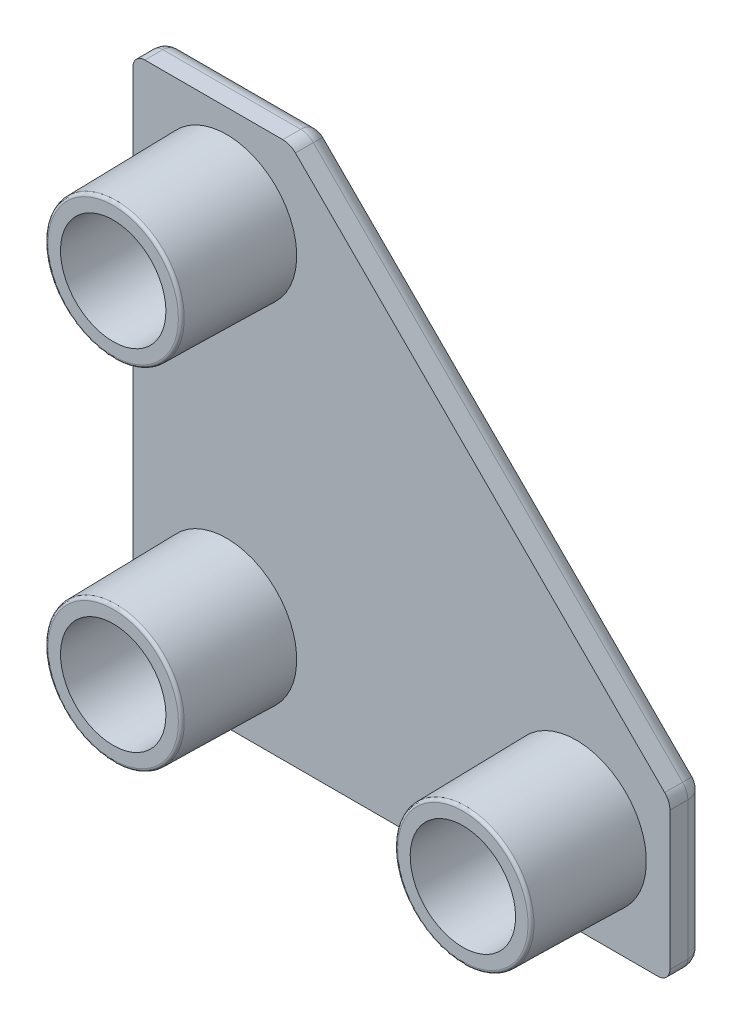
ISO-10303-21;
HEADER;
FILE_DESCRIPTION(('STEP AP214'),'2;1');
FILE_NAME('part.step','',(''),(''),'','','');
FILE_SCHEMA(('AUTOMOTIVE_DESIGN { 1 0 10303 214 1 1 1 1 }'));
ENDSEC;
DATA;
#1=APPLICATION_CONTEXT('core data for automotive mechanical design processes');
#2=APPLICATION_PROTOCOL_DEFINITION('international standard','automotive_design',2000,#1);
#3=PRODUCT_CONTEXT('',#1,'mechanical');
#4=PRODUCT('Part','Part','',(#3));
#5=PRODUCT_RELATED_PRODUCT_CATEGORY('part','',(#4));
#6=PRODUCT_DEFINITION_FORMATION('','',#4);
#7=PRODUCT_DEFINITION_CONTEXT('part definition',#1,'design');
#8=PRODUCT_DEFINITION('design','',#6,#7);
#9=PRODUCT_DEFINITION_SHAPE('','',#8);
#10=(LENGTH_UNIT() NAMED_UNIT(*) SI_UNIT(.MILLI.,.METRE.));
#11=(NAMED_UNIT(*) PLANE_ANGLE_UNIT() SI_UNIT($,.RADIAN.));
#12=(NAMED_UNIT(*) SI_UNIT($,.STERADIAN.) SOLID_ANGLE_UNIT());
#13=UNCERTAINTY_MEASURE_WITH_UNIT(LENGTH_MEASURE(1.E-05),#10,'distance_accuracy_value','');
#14=(GEOMETRIC_REPRESENTATION_CONTEXT(3) GLOBAL_UNCERTAINTY_ASSIGNED_CONTEXT((#13)) GLOBAL_UNIT_ASSIGNED_CONTEXT((#10,
#11,#12)) REPRESENTATION_CONTEXT('',''));
#15=CARTESIAN_POINT('',(0.,0.,0.));
#16=DIRECTION('',(0.,0.,1.));
#17=DIRECTION('',(1.,0.,0.));
#18=AXIS2_PLACEMENT_3D('',#15,#16,#17);
#19=CARTESIAN_POINT('',(-3.89867941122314,-3.89867941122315,3.));
#20=DIRECTION('',(0.,0.,1.));
#21=DIRECTION('',(1.,0.,0.));
#22=AXIS2_PLACEMENT_3D('',#19,#20,#21);
#23=PLANE('',#22);
#24=CARTESIAN_POINT('',(14.65,-14.65,2.9999999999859));
#25=DIRECTION('',(0.,0.,1.));
#26=DIRECTION('',(0.,-1.,0.));
#27=AXIS2_PLACEMENT_3D('',#24,#25,#26);
#28=CIRCLE('',#27,4.24999999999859);
#29=CARTESIAN_POINT('',(14.65,-18.8999999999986,2.9999999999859));
#30=VERTEX_POINT('',#29);
#31=EDGE_CURVE('E23',#30,#30,#28,.T.);
#32=ORIENTED_EDGE('',*,*,#31,.T.);
#33=EDGE_LOOP('',(#32));
#34=FACE_BOUND('',#33,.T.);
#35=ADVANCED_FACE('F16',(#34),#23,.T.);
#36=CARTESIAN_POINT('',(-3.89867941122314,-3.89867941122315,3.));
#37=DIRECTION('',(0.,0.,1.));
#38=DIRECTION('',(1.,0.,0.));
#39=AXIS2_PLACEMENT_3D('',#36,#37,#38);
#40=PLANE('',#39);
#41=CARTESIAN_POINT('',(-14.65,-14.65,2.9999999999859));
#42=DIRECTION('',(0.,0.,1.));
#43=DIRECTION('',(0.,-1.,0.));
#44=AXIS2_PLACEMENT_3D('',#41,#42,#43);
#45=CIRCLE('',#44,4.24999999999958);
#46=CARTESIAN_POINT('',(-14.65,-18.8999999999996,2.9999999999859));
#47=VERTEX_POINT('',#46);
#48=EDGE_CURVE('E659',#47,#47,#45,.T.);
#49=ORIENTED_EDGE('',*,*,#48,.T.);
#50=EDGE_LOOP('',(#49));
#51=FACE_BOUND('',#50,.T.);
#52=ADVANCED_FACE('F686',(#51),#40,.T.);
#53=CARTESIAN_POINT('',(-3.89867941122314,-3.89867941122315,3.));
#54=DIRECTION('',(0.,0.,1.));
#55=DIRECTION('',(1.,0.,0.));
#56=AXIS2_PLACEMENT_3D('',#53,#54,#55);
#57=PLANE('',#56);
#58=CARTESIAN_POINT('',(-14.65,14.65,2.9999999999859));
#59=DIRECTION('',(0.,0.,1.));
#60=DIRECTION('',(0.,-1.,0.));
#61=AXIS2_PLACEMENT_3D('',#58,#59,#60);
#62=CIRCLE('',#61,4.24999999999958);
#63=CARTESIAN_POINT('',(-14.65,10.4000000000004,2.9999999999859));
#64=VERTEX_POINT('',#63);
#65=EDGE_CURVE('E656',#64,#64,#62,.T.);
#66=ORIENTED_EDGE('',*,*,#65,.T.);
#67=EDGE_LOOP('',(#66));
#68=FACE_BOUND('',#67,.T.);
#69=ADVANCED_FACE('F674',(#68),#57,.T.);
#70=CARTESIAN_POINT('',(14.65,-14.65,12.4999999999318));
#71=DIRECTION('',(0.,0.,1.));
#72=DIRECTION('',(0.,-1.,0.));
#73=AXIS2_PLACEMENT_3D('',#70,#71,#72);
#74=CONICAL_SURFACE('',#73,4.41582311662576,0.0174532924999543);
#75=ORIENTED_EDGE('',*,*,#31,.F.);
#76=EDGE_LOOP('',(#75));
#77=FACE_BOUND('',#76,.T.);
#78=CARTESIAN_POINT('',(14.65,-14.65,12.4999999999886));
#79=DIRECTION('',(0.,0.,1.));
#80=DIRECTION('',(0.,-1.,0.));
#81=AXIS2_PLACEMENT_3D('',#78,#79,#80);
#82=CIRCLE('',#81,4.41582311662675);
#83=CARTESIAN_POINT('',(14.65,-19.0658231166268,12.4999999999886));
#84=VERTEX_POINT('',#83);
#85=EDGE_CURVE('E649',#84,#84,#82,.T.);
#86=ORIENTED_EDGE('',*,*,#85,.T.);
#87=EDGE_LOOP('',(#86));
#88=FACE_BOUND('',#87,.T.);
#89=ADVANCED_FACE('F670',(#77,#88),#74,.F.);
#90=CARTESIAN_POINT('',(-14.65,-14.65,12.4999999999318));
#91=DIRECTION('',(0.,0.,1.));
#92=DIRECTION('',(0.,-1.,0.));
#93=AXIS2_PLACEMENT_3D('',#90,#91,#92);
#94=CONICAL_SURFACE('',#93,4.41582311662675,0.0174532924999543);
#95=ORIENTED_EDGE('',*,*,#48,.F.);
#96=EDGE_LOOP('',(#95));
#97=FACE_BOUND('',#96,.T.);
#98=CARTESIAN_POINT('',(-14.65,-14.65,12.4999999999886));
#99=DIRECTION('',(0.,0.,1.));
#100=DIRECTION('',(0.,-1.,0.));
#101=AXIS2_PLACEMENT_3D('',#98,#99,#100);
#102=CIRCLE('',#101,4.41582311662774);
#103=CARTESIAN_POINT('',(-14.65,-19.0658231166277,12.4999999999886));
#104=VERTEX_POINT('',#103);
#105=EDGE_CURVE('E644',#104,#104,#102,.T.);
#106=ORIENTED_EDGE('',*,*,#105,.T.);
#107=EDGE_LOOP('',(#106));
#108=FACE_BOUND('',#107,.T.);
#109=ADVANCED_FACE('F673',(#97,#108),#94,.F.);
#110=CARTESIAN_POINT('',(-14.65,14.65,12.4999999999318));
#111=DIRECTION('',(0.,0.,1.));
#112=DIRECTION('',(0.,-1.,0.));
#113=AXIS2_PLACEMENT_3D('',#110,#111,#112);
#114=CONICAL_SURFACE('',#113,4.41582311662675,0.0174532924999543);
#115=ORIENTED_EDGE('',*,*,#65,.F.);
#116=EDGE_LOOP('',(#115));
#117=FACE_BOUND('',#116,.T.);
#118=CARTESIAN_POINT('',(-14.65,14.65,12.4999999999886));
#119=DIRECTION('',(0.,0.,1.));
#120=DIRECTION('',(0.,-1.,0.));
#121=AXIS2_PLACEMENT_3D('',#118,#119,#120);
#122=CIRCLE('',#121,4.41582311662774);
#123=CARTESIAN_POINT('',(-14.65,10.2341768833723,12.4999999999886));
#124=VERTEX_POINT('',#123);
#125=EDGE_CURVE('E641',#124,#124,#122,.T.);
#126=ORIENTED_EDGE('',*,*,#125,.T.);
#127=EDGE_LOOP('',(#126));
#128=FACE_BOUND('',#127,.T.);
#129=ADVANCED_FACE('F597',(#117,#128),#114,.F.);
#130=CARTESIAN_POINT('',(14.65,-14.65,12.5));
#131=DIRECTION('',(0.,0.,-1.));
#132=DIRECTION('',(-1.,0.,0.));
#133=AXIS2_PLACEMENT_3D('',#130,#131,#132);
#134=PLANE('',#133);
#135=ORIENTED_EDGE('',*,*,#85,.F.);
#136=EDGE_LOOP('',(#135));
#137=FACE_BOUND('',#136,.T.);
#138=CARTESIAN_POINT('',(14.65,-14.65,12.5));
#139=DIRECTION('',(0.,0.,-1.));
#140=DIRECTION('',(1.,0.,0.));
#141=AXIS2_PLACEMENT_3D('',#138,#139,#140);
#142=CIRCLE('',#141,5.46350256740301);
#143=CARTESIAN_POINT('',(20.113502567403,-14.65,12.5));
#144=VERTEX_POINT('',#143);
#145=EDGE_CURVE('E614',#144,#144,#142,.T.);
#146=ORIENTED_EDGE('',*,*,#145,.F.);
#147=EDGE_LOOP('',(#146));
#148=FACE_BOUND('',#147,.T.);
#149=ADVANCED_FACE('F591',(#137,#148),#134,.F.);
#150=CARTESIAN_POINT('',(-14.65,-14.65,12.5));
#151=DIRECTION('',(0.,0.,-1.));
#152=DIRECTION('',(-1.,0.,0.));
#153=AXIS2_PLACEMENT_3D('',#150,#151,#152);
#154=PLANE('',#153);
#155=ORIENTED_EDGE('',*,*,#105,.F.);
#156=EDGE_LOOP('',(#155));
#157=FACE_BOUND('',#156,.T.);
#158=CARTESIAN_POINT('',(-14.65,-14.65,12.5));
#159=DIRECTION('',(0.,0.,-1.));
#160=DIRECTION('',(1.,0.,0.));
#161=AXIS2_PLACEMENT_3D('',#158,#159,#160);
#162=CIRCLE('',#161,5.46350256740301);
#163=CARTESIAN_POINT('',(-9.18649743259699,-14.65,12.5));
#164=VERTEX_POINT('',#163);
#165=EDGE_CURVE('E574',#164,#164,#162,.T.);
#166=ORIENTED_EDGE('',*,*,#165,.F.);
#167=EDGE_LOOP('',(#166));
#168=FACE_BOUND('',#167,.T.);
#169=ADVANCED_FACE('F580',(#157,#168),#154,.F.);
#170=CARTESIAN_POINT('',(-14.65,14.65,12.5));
#171=DIRECTION('',(0.,0.,-1.));
#172=DIRECTION('',(-1.,0.,0.));
#173=AXIS2_PLACEMENT_3D('',#170,#171,#172);
#174=PLANE('',#173);
#175=ORIENTED_EDGE('',*,*,#125,.F.);
#176=EDGE_LOOP('',(#175));
#177=FACE_BOUND('',#176,.T.);
#178=CARTESIAN_POINT('',(-14.65,14.65,12.5));
#179=DIRECTION('',(0.,0.,-1.));
#180=DIRECTION('',(1.,0.,0.));
#181=AXIS2_PLACEMENT_3D('',#178,#179,#180);
#182=CIRCLE('',#181,5.46350256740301);
#183=CARTESIAN_POINT('',(-9.18649743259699,14.65,12.5));
#184=VERTEX_POINT('',#183);
#185=EDGE_CURVE('E539',#184,#184,#182,.T.);
#186=ORIENTED_EDGE('',*,*,#185,.F.);
#187=EDGE_LOOP('',(#186));
#188=FACE_BOUND('',#187,.T.);
#189=ADVANCED_FACE('F590',(#177,#188),#174,.F.);
#190=CARTESIAN_POINT('',(14.65,-14.65,12.25));
#191=DIRECTION('',(0.,0.,-1.));
#192=DIRECTION('',(-1.,0.,0.));
#193=AXIS2_PLACEMENT_3D('',#190,#191,#192);
#194=TOROIDAL_SURFACE('',#193,5.46350256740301,0.25);
#195=CARTESIAN_POINT('',(14.65,-14.65,12.2543631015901));
#196=DIRECTION('',(0.,0.,-1.));
#197=DIRECTION('',(-1.,0.,0.));
#198=AXIS2_PLACEMENT_3D('',#195,#196,#197);
#199=CIRCLE('',#198,5.71346449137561);
#200=CARTESIAN_POINT('',(8.93653550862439,-14.65,12.2543631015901));
#201=VERTEX_POINT('',#200);
#202=EDGE_CURVE('E533',#201,#201,#199,.T.);
#203=ORIENTED_EDGE('',*,*,#202,.F.);
#204=EDGE_LOOP('',(#203));
#205=FACE_BOUND('',#204,.T.);
#206=ORIENTED_EDGE('',*,*,#145,.T.);
#207=EDGE_LOOP('',(#206));
#208=FACE_BOUND('',#207,.T.);
#209=ADVANCED_FACE('F617',(#205,#208),#194,.T.);
#210=CARTESIAN_POINT('',(-14.65,-14.65,12.25));
#211=DIRECTION('',(0.,0.,-1.));
#212=DIRECTION('',(-1.,0.,0.));
#213=AXIS2_PLACEMENT_3D('',#210,#211,#212);
#214=TOROIDAL_SURFACE('',#213,5.46350256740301,0.25);
#215=CARTESIAN_POINT('',(-14.65,-14.65,12.2543631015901));
#216=DIRECTION('',(0.,0.,-1.));
#217=DIRECTION('',(-1.,0.,0.));
#218=AXIS2_PLACEMENT_3D('',#215,#216,#217);
#219=CIRCLE('',#218,5.71346449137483);
#220=CARTESIAN_POINT('',(-20.3634644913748,-14.65,12.2543631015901));
#221=VERTEX_POINT('',#220);
#222=EDGE_CURVE('E527',#221,#221,#219,.T.);
#223=ORIENTED_EDGE('',*,*,#222,.F.);
#224=EDGE_LOOP('',(#223));
#225=FACE_BOUND('',#224,.T.);
#226=ORIENTED_EDGE('',*,*,#165,.T.);
#227=EDGE_LOOP('',(#226));
#228=FACE_BOUND('',#227,.T.);
#229=ADVANCED_FACE('F553',(#225,#228),#214,.T.);
#230=CARTESIAN_POINT('',(-14.65,14.65,12.25));
#231=DIRECTION('',(0.,0.,-1.));
#232=DIRECTION('',(-1.,0.,0.));
#233=AXIS2_PLACEMENT_3D('',#230,#231,#232);
#234=TOROIDAL_SURFACE('',#233,5.46350256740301,0.25);
#235=CARTESIAN_POINT('',(-14.65,14.65,12.2543631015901));
#236=DIRECTION('',(0.,0.,-1.));
#237=DIRECTION('',(-1.,0.,0.));
#238=AXIS2_PLACEMENT_3D('',#235,#236,#237);
#239=CIRCLE('',#238,5.71346449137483);
#240=CARTESIAN_POINT('',(-20.3634644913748,14.65,12.2543631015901));
#241=VERTEX_POINT('',#240);
#242=EDGE_CURVE('E109',#241,#241,#239,.T.);
#243=ORIENTED_EDGE('',*,*,#242,.F.);
#244=EDGE_LOOP('',(#243));
#245=FACE_BOUND('',#244,.T.);
#246=ORIENTED_EDGE('',*,*,#185,.T.);
#247=EDGE_LOOP('',(#246));
#248=FACE_BOUND('',#247,.T.);
#249=ADVANCED_FACE('F547',(#245,#248),#234,.T.);
#250=CARTESIAN_POINT('',(14.65,-14.65,2.9999999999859));
#251=DIRECTION('',(0.,0.,-1.));
#252=DIRECTION('',(-1.,0.,0.));
#253=AXIS2_PLACEMENT_3D('',#250,#251,#252);
#254=CONICAL_SURFACE('',#253,5.87499999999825,0.0174532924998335);
#255=ORIENTED_EDGE('',*,*,#202,.T.);
#256=EDGE_LOOP('',(#255));
#257=FACE_BOUND('',#256,.T.);
#258=CARTESIAN_POINT('',(14.65,-14.65,2.9999999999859));
#259=DIRECTION('',(0.,0.,-1.));
#260=DIRECTION('',(-1.,0.,0.));
#261=AXIS2_PLACEMENT_3D('',#258,#259,#260);
#262=CIRCLE('',#261,5.87499999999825);
#263=CARTESIAN_POINT('',(8.77500000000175,-14.65,2.9999999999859));
#264=VERTEX_POINT('',#263);
#265=EDGE_CURVE('E878',#264,#264,#262,.T.);
#266=ORIENTED_EDGE('',*,*,#265,.F.);
#267=EDGE_LOOP('',(#266));
#268=FACE_BOUND('',#267,.T.);
#269=ADVANCED_FACE('F552',(#257,#268),#254,.T.);
#270=CARTESIAN_POINT('',(-14.65,-14.65,2.9999999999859));
#271=DIRECTION('',(0.,0.,-1.));
#272=DIRECTION('',(-1.,0.,0.));
#273=AXIS2_PLACEMENT_3D('',#270,#271,#272);
#274=CONICAL_SURFACE('',#273,5.87499999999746,0.0174532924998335);
#275=ORIENTED_EDGE('',*,*,#222,.T.);
#276=EDGE_LOOP('',(#275));
#277=FACE_BOUND('',#276,.T.);
#278=CARTESIAN_POINT('',(-14.65,-14.65,2.9999999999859));
#279=DIRECTION('',(0.,0.,-1.));
#280=DIRECTION('',(-1.,0.,0.));
#281=AXIS2_PLACEMENT_3D('',#278,#279,#280);
#282=CIRCLE('',#281,5.87499999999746);
#283=CARTESIAN_POINT('',(-20.5249999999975,-14.65,2.9999999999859));
#284=VERTEX_POINT('',#283);
#285=EDGE_CURVE('E873',#284,#284,#282,.T.);
#286=ORIENTED_EDGE('',*,*,#285,.F.);
#287=EDGE_LOOP('',(#286));
#288=FACE_BOUND('',#287,.T.);
#289=ADVANCED_FACE('F754',(#277,#288),#274,.T.);
#290=CARTESIAN_POINT('',(-14.65,14.65,2.9999999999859));
#291=DIRECTION('',(0.,0.,-1.));
#292=DIRECTION('',(-1.,0.,0.));
#293=AXIS2_PLACEMENT_3D('',#290,#291,#292);
#294=CONICAL_SURFACE('',#293,5.87499999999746,0.0174532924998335);
#295=ORIENTED_EDGE('',*,*,#242,.T.);
#296=EDGE_LOOP('',(#295));
#297=FACE_BOUND('',#296,.T.);
#298=CARTESIAN_POINT('',(-14.65,14.65,2.9999999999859));
#299=DIRECTION('',(0.,0.,-1.));
#300=DIRECTION('',(-1.,0.,0.));
#301=AXIS2_PLACEMENT_3D('',#298,#299,#300);
#302=CIRCLE('',#301,5.87499999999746);
#303=CARTESIAN_POINT('',(-20.5249999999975,14.65,2.9999999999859));
#304=VERTEX_POINT('',#303);
#305=EDGE_CURVE('E871',#304,#304,#302,.T.);
#306=ORIENTED_EDGE('',*,*,#305,.F.);
#307=EDGE_LOOP('',(#306));
#308=FACE_BOUND('',#307,.T.);
#309=ADVANCED_FACE('F761',(#297,#308),#294,.T.);
#310=CARTESIAN_POINT('',(-21.5,21.5,0.));
#311=DIRECTION('',(0.,0.,1.));
#312=DIRECTION('',(1.,0.,0.));
#313=AXIS2_PLACEMENT_3D('',#310,#311,#312);
#314=CYLINDRICAL_SURFACE('',#313,1.);
#315=CARTESIAN_POINT('',(-21.5,21.5,3.));
#316=DIRECTION('',(0.,0.,1.));
#317=DIRECTION('',(1.,0.,0.));
#318=AXIS2_PLACEMENT_3D('',#315,#316,#317);
#319=CIRCLE('',#318,1.);
#320=CARTESIAN_POINT('',(-21.5,22.5,3.));
#321=VERTEX_POINT('',#320);
#322=CARTESIAN_POINT('',(-22.5,21.5,3.));
#323=VERTEX_POINT('',#322);
#324=EDGE_CURVE('E108',#321,#323,#319,.T.);
#325=ORIENTED_EDGE('',*,*,#324,.F.);
#326=DIRECTION('',(0.,0.,1.));
#327=VECTOR('',#326,1.);
#328=CARTESIAN_POINT('',(-21.5,22.5,0.));
#329=LINE('',#328,#327);
#330=CARTESIAN_POINT('',(-21.5,22.5,1.5));
#331=VERTEX_POINT('',#330);
#332=EDGE_CURVE('E236',#331,#321,#329,.T.);
#333=ORIENTED_EDGE('',*,*,#332,.F.);
#334=CARTESIAN_POINT('',(-22.5,21.5,1.5));
#335=CARTESIAN_POINT('',(-22.5000000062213,21.5130898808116,1.5));
#336=CARTESIAN_POINT('',(-22.4997405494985,21.5261796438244,1.5));
#337=CARTESIAN_POINT('',(-22.4987061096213,21.5523387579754,1.5));
#338=CARTESIAN_POINT('',(-22.4979311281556,21.5654081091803,1.5));
#339=CARTESIAN_POINT('',(-22.4958690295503,21.5915064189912,1.5));
#340=CARTESIAN_POINT('',(-22.4945819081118,21.6045353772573,1.5));
#341=CARTESIAN_POINT('',(-22.4914989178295,21.6305330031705,1.5));
#342=CARTESIAN_POINT('',(-22.4897030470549,21.6435016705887,1.5));
#343=CARTESIAN_POINT('',(-22.4856059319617,21.669358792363,1.5));
#344=CARTESIAN_POINT('',(-22.4833046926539,21.6822472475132,1.5));
#345=CARTESIAN_POINT('',(-22.4782002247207,21.7079240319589,1.5));
#346=CARTESIAN_POINT('',(-22.4753970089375,21.7207123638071,1.5));
#347=CARTESIAN_POINT('',(-22.4692919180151,21.746168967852,1.5));
#348=CARTESIAN_POINT('',(-22.4659900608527,21.7588372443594,1.5));
#349=CARTESIAN_POINT('',(-22.4588912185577,21.7840338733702,1.5));
#350=CARTESIAN_POINT('',(-22.4550942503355,21.7965622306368,1.5));
#351=CARTESIAN_POINT('',(-22.447007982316,21.8214588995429,1.5));
#352=CARTESIAN_POINT('',(-22.442718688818,21.8338272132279,1.5));
#353=CARTESIAN_POINT('',(-22.4336539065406,21.8583846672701,1.5));
#354=CARTESIAN_POINT('',(-22.4288784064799,21.8705738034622,1.5));
#355=CARTESIAN_POINT('',(-22.418851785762,21.8947554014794,1.5));
#356=CARTESIAN_POINT('',(-22.4136006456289,21.9067478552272,1.5));
#357=CARTESIAN_POINT('',(-22.4026324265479,21.9305182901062,1.5));
#358=CARTESIAN_POINT('',(-22.396915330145,21.9422962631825,1.5));
#359=CARTESIAN_POINT('',(-22.3850251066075,21.9656200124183,1.5));
#360=CARTESIAN_POINT('',(-22.3788519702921,21.9771657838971,1.5));
#361=CARTESIAN_POINT('',(-22.3660595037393,22.0000073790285,1.5));
#362=CARTESIAN_POINT('',(-22.3594401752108,22.0113032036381,1.5));
#363=CARTESIAN_POINT('',(-22.3457651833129,22.0336271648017,1.5));
#364=CARTESIAN_POINT('',(-22.3387095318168,22.0446553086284,1.5));
#365=CARTESIAN_POINT('',(-22.3241717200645,22.066426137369,1.5));
#366=CARTESIAN_POINT('',(-22.3166895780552,22.0771688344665,1.5));
#367=CARTESIAN_POINT('',(-22.3013087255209,22.0983511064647,1.5));
#368=CARTESIAN_POINT('',(-22.2934100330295,22.1087906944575,1.5));
#369=CARTESIAN_POINT('',(-22.2772056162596,22.1293486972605,1.5));
#370=CARTESIAN_POINT('',(-22.2688999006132,22.1394671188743,1.5));
#371=CARTESIAN_POINT('',(-22.2518957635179,22.1593686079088,1.5));
#372=CARTESIAN_POINT('',(-22.243197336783,22.1691516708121,1.5));
#373=CARTESIAN_POINT('',(-22.2254227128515,22.1883689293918,1.5));
#374=CARTESIAN_POINT('',(-22.2163465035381,22.1978031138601,1.5));
#375=CARTESIAN_POINT('',(-22.1978310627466,22.2163089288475,1.5));
#376=CARTESIAN_POINT('',(-22.1883918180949,22.2253805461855,1.5));
#377=CARTESIAN_POINT('',(-22.1691651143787,22.2431475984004,1.5));
#378=CARTESIAN_POINT('',(-22.1593776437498,22.2518430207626,1.5));
#379=CARTESIAN_POINT('',(-22.1394692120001,22.2688439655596,1.5));
#380=CARTESIAN_POINT('',(-22.1293482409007,22.2771494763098,1.5));
#381=CARTESIAN_POINT('',(-22.108787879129,22.2933571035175,1.5));
#382=CARTESIAN_POINT('',(-22.0983484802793,22.3012592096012,1.5));
#383=CARTESIAN_POINT('',(-22.0771681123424,22.3166484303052,1.5));
#384=CARTESIAN_POINT('',(-22.066427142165,22.3241355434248,1.5));
#385=CARTESIAN_POINT('',(-22.0446603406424,22.3386829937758,1.5));
#386=CARTESIAN_POINT('',(-22.0336345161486,22.3457433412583,1.5));
#387=CARTESIAN_POINT('',(-22.0113147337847,22.3594254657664,1.5));
#388=CARTESIAN_POINT('',(-22.0000207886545,22.3660472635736,1.5));
#389=CARTESIAN_POINT('',(-21.9771815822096,22.3788406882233,1.5));
#390=CARTESIAN_POINT('',(-21.965636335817,22.385012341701,1.5));
#391=CARTESIAN_POINT('',(-21.9423109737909,22.3968931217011,1.5));
#392=CARTESIAN_POINT('',(-21.9305308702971,22.4026022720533,1.5));
#393=CARTESIAN_POINT('',(-21.9067538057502,22.4135491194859,1.5));
#394=CARTESIAN_POINT('',(-21.8947568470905,22.4187868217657,1.5));
#395=CARTESIAN_POINT('',(-21.8705659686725,22.4287866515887,1.5));
#396=CARTESIAN_POINT('',(-21.8583720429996,22.4335487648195,1.5));
#397=CARTESIAN_POINT('',(-21.8338066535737,22.4425923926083,1.5));
#398=CARTESIAN_POINT('',(-21.8214351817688,22.4468738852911,1.5));
#399=CARTESIAN_POINT('',(-21.7965342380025,22.4549514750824,1.5));
#400=CARTESIAN_POINT('',(-21.7840047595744,22.4587475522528,1.5));
#401=CARTESIAN_POINT('',(-21.7588073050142,22.4658494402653,1.5));
#402=CARTESIAN_POINT('',(-21.7461393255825,22.4691552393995,1.5));
#403=CARTESIAN_POINT('',(-21.7206843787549,22.475271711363,1.5));
#404=CARTESIAN_POINT('',(-21.707897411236,22.4780823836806,1.5));
#405=CARTESIAN_POINT('',(-21.6822239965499,22.4832037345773,1.5));
#406=CARTESIAN_POINT('',(-21.6693375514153,22.4855144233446,1.5));
#407=CARTESIAN_POINT('',(-21.6434846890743,22.489630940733,1.5));
#408=CARTESIAN_POINT('',(-21.6305182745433,22.4914367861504,1.5));
#409=CARTESIAN_POINT('',(-21.6045249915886,22.4945387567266,1.5));
#410=CARTESIAN_POINT('',(-21.5914981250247,22.4958348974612,1.5));
#411=CARTESIAN_POINT('',(-21.5654034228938,22.4979125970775,1.5));
#412=CARTESIAN_POINT('',(-21.5523355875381,22.4986941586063,1.5));
#413=CARTESIAN_POINT('',(-21.5261785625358,22.4997378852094,1.5));
#414=CARTESIAN_POINT('',(-21.5130893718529,22.5000000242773,1.5));
#415=CARTESIAN_POINT('',(-21.5,22.5,1.5));
#416=B_SPLINE_CURVE_WITH_KNOTS('',3,(#334,#335,#336,#337,#338,#339,#340,#341,#342,#343,#344,
#345,#346,#347,#348,#349,#350,#351,#352,#353,#354,#355,#356,#357,#358,#359,#360,#361,#362,#363,
#364,#365,#366,#367,#368,#369,#370,#371,#372,#373,#374,#375,#376,#377,#378,#379,#380,#381,#382,
#383,#384,#385,#386,#387,#388,#389,#390,#391,#392,#393,#394,#395,#396,#397,#398,#399,#400,#401,
#402,#403,#404,#405,#406,#407,#408,#409,#410,#411,#412,#413,#414,#415),.UNSPECIFIED.,.F.,.F.,(4,
2,2,2,2,2,2,2,2,2,2,2,2,2,2,2,2,2,2,2,2,2,2,2,2,2,2,2,2,2,2,2,2,2,2,2,2,2,2,2,4),(0.,
0.0392669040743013,0.0785336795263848,0.1178007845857,0.1570680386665,0.196334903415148,
0.235600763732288,0.274865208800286,0.314128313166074,0.353390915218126,0.392654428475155,
0.431919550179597,0.47118614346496,0.51045352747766,0.549720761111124,0.588986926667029,
0.628251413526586,0.667514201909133,0.706776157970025,0.746038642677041,0.785302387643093,
0.824567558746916,0.86383403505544,0.903101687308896,0.942370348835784,0.981639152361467,
1.02090701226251,1.06017301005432,1.09943668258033,1.13869833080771,1.17795954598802,
1.21722194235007,1.25648612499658,1.29575191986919,1.3350186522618,1.37428542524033,
1.41355139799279,1.45281606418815,1.49207953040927,1.53134279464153,1.57060802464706),.UNSPECIFIED.);
#417=CARTESIAN_POINT('',(-22.5,21.5000000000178,1.5));
#418=VERTEX_POINT('',#417);
#419=EDGE_CURVE('E199',#418,#331,#416,.T.);
#420=ORIENTED_EDGE('',*,*,#419,.F.);
#421=DIRECTION('',(0.,0.,1.));
#422=VECTOR('',#421,1.);
#423=CARTESIAN_POINT('',(-22.5,21.5,0.));
#424=LINE('',#423,#422);
#425=EDGE_CURVE('E190',#323,#418,#424,.F.);
#426=ORIENTED_EDGE('',*,*,#425,.F.);
#427=EDGE_LOOP('',(#325,#333,#420,#426));
#428=FACE_BOUND('',#427,.T.);
#429=ADVANCED_FACE('F170',(#428),#314,.T.);
#430=CARTESIAN_POINT('',(-21.5,-21.5,0.));
#431=DIRECTION('',(0.,0.,1.));
#432=DIRECTION('',(1.,0.,0.));
#433=AXIS2_PLACEMENT_3D('',#430,#431,#432);
#434=CYLINDRICAL_SURFACE('',#433,1.);
#435=CARTESIAN_POINT('',(-21.5,-21.5,3.));
#436=DIRECTION('',(0.,0.,1.));
#437=DIRECTION('',(1.,0.,0.));
#438=AXIS2_PLACEMENT_3D('',#435,#436,#437);
#439=CIRCLE('',#438,1.);
#440=CARTESIAN_POINT('',(-22.5,-21.5,3.));
#441=VERTEX_POINT('',#440);
#442=CARTESIAN_POINT('',(-21.5,-22.5,3.));
#443=VERTEX_POINT('',#442);
#444=EDGE_CURVE('E885',#441,#443,#439,.T.);
#445=ORIENTED_EDGE('',*,*,#444,.F.);
#446=DIRECTION('',(0.,0.,1.));
#447=VECTOR('',#446,1.);
#448=CARTESIAN_POINT('',(-22.5,-21.5,0.));
#449=LINE('',#448,#447);
#450=CARTESIAN_POINT('',(-22.5,-21.5,1.5));
#451=VERTEX_POINT('',#450);
#452=EDGE_CURVE('E191',#451,#441,#449,.T.);
#453=ORIENTED_EDGE('',*,*,#452,.F.);
#454=CARTESIAN_POINT('',(-21.5,-22.5,1.5));
#455=CARTESIAN_POINT('',(-21.6121997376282,-22.5,1.5));
#456=CARTESIAN_POINT('',(-21.8365639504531,-22.461876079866,1.5));
#457=CARTESIAN_POINT('',(-22.1021506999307,-22.3150634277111,1.5));
#458=CARTESIAN_POINT('',(-22.2883243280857,-22.1287012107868,1.5));
#459=CARTESIAN_POINT('',(-22.4486419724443,-21.8738200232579,1.5));
#460=CARTESIAN_POINT('',(-22.5,-21.649599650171,1.5));
#461=CARTESIAN_POINT('',(-22.5,-21.5,1.5));
#462=B_SPLINE_CURVE_WITH_KNOTS('',3,(#454,#455,#456,#457,#458,#459,#460,#461),.UNSPECIFIED.,.F.,
.F.,(4,1,1,1,1,4),(0.,0.214285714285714,0.428571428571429,0.571428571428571,0.714285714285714,
1.),.UNSPECIFIED.);
#463=CARTESIAN_POINT('',(-21.5000000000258,-22.5,1.5));
#464=VERTEX_POINT('',#463);
#465=EDGE_CURVE('E490',#464,#451,#462,.T.);
#466=ORIENTED_EDGE('',*,*,#465,.F.);
#467=DIRECTION('',(0.,0.,-1.));
#468=VECTOR('',#467,1.);
#469=CARTESIAN_POINT('',(-21.5,-22.5,0.));
#470=LINE('',#469,#468);
#471=EDGE_CURVE('E893',#443,#464,#470,.T.);
#472=ORIENTED_EDGE('',*,*,#471,.F.);
#473=EDGE_LOOP('',(#445,#453,#466,#472));
#474=FACE_BOUND('',#473,.T.);
#475=ADVANCED_FACE('F165',(#474),#434,.T.);
#476=CARTESIAN_POINT('',(21.5,-21.5,0.));
#477=DIRECTION('',(0.,0.,1.));
#478=DIRECTION('',(1.,0.,0.));
#479=AXIS2_PLACEMENT_3D('',#476,#477,#478);
#480=CYLINDRICAL_SURFACE('',#479,1.);
#481=CARTESIAN_POINT('',(21.5,-21.5,3.));
#482=DIRECTION('',(0.,0.,1.));
#483=DIRECTION('',(1.,0.,0.));
#484=AXIS2_PLACEMENT_3D('',#481,#482,#483);
#485=CIRCLE('',#484,1.);
#486=CARTESIAN_POINT('',(21.5,-22.5,3.));
#487=VERTEX_POINT('',#486);
#488=CARTESIAN_POINT('',(22.5,-21.5,3.));
#489=VERTEX_POINT('',#488);
#490=EDGE_CURVE('E883',#487,#489,#485,.T.);
#491=ORIENTED_EDGE('',*,*,#490,.F.);
#492=DIRECTION('',(0.,0.,-1.));
#493=VECTOR('',#492,1.);
#494=CARTESIAN_POINT('',(21.5,-22.5,0.));
#495=LINE('',#494,#493);
#496=CARTESIAN_POINT('',(21.5,-22.5,1.5));
#497=VERTEX_POINT('',#496);
#498=EDGE_CURVE('E894',#497,#487,#495,.F.);
#499=ORIENTED_EDGE('',*,*,#498,.F.);
#500=CARTESIAN_POINT('',(22.5,-21.5,1.5));
#501=CARTESIAN_POINT('',(22.5,-21.6121997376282,1.5));
#502=CARTESIAN_POINT('',(22.461876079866,-21.8365639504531,1.5));
#503=CARTESIAN_POINT('',(22.3150634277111,-22.1021506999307,1.5));
#504=CARTESIAN_POINT('',(22.1287012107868,-22.2883243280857,1.5));
#505=CARTESIAN_POINT('',(21.8738200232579,-22.4486419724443,1.5));
#506=CARTESIAN_POINT('',(21.649599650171,-22.5,1.5));
#507=CARTESIAN_POINT('',(21.5,-22.5,1.5));
#508=B_SPLINE_CURVE_WITH_KNOTS('',3,(#500,#501,#502,#503,#504,#505,#506,#507),.UNSPECIFIED.,.F.,
.F.,(4,1,1,1,1,4),(0.,0.214285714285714,0.428571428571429,0.571428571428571,0.714285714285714,
1.),.UNSPECIFIED.);
#509=CARTESIAN_POINT('',(22.5,-21.5000000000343,1.5));
#510=VERTEX_POINT('',#509);
#511=EDGE_CURVE('E135',#510,#497,#508,.T.);
#512=ORIENTED_EDGE('',*,*,#511,.F.);
#513=DIRECTION('',(0.,0.,-1.));
#514=VECTOR('',#513,1.);
#515=CARTESIAN_POINT('',(22.5,-21.5,0.));
#516=LINE('',#515,#514);
#517=EDGE_CURVE('E906',#489,#510,#516,.T.);
#518=ORIENTED_EDGE('',*,*,#517,.F.);
#519=EDGE_LOOP('',(#491,#499,#512,#518));
#520=FACE_BOUND('',#519,.T.);
#521=ADVANCED_FACE('F155',(#520),#480,.T.);
#522=CARTESIAN_POINT('',(-9.94132034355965,21.,0.));
#523=DIRECTION('',(0.,0.,1.));
#524=DIRECTION('',(1.,0.,0.));
#525=AXIS2_PLACEMENT_3D('',#522,#523,#524);
#526=CYLINDRICAL_SURFACE('',#525,1.5);
#527=CARTESIAN_POINT('',(-9.94132034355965,21.,1.5));
#528=DIRECTION('',(0.,0.,1.));
#529=DIRECTION('',(1.,0.,0.));
#530=AXIS2_PLACEMENT_3D('',#527,#528,#529);
#531=CIRCLE('',#530,1.5);
#532=CARTESIAN_POINT('',(-9.94132034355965,22.5,1.5));
#533=VERTEX_POINT('',#532);
#534=CARTESIAN_POINT('',(-8.88066017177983,22.0606601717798,1.5));
#535=VERTEX_POINT('',#534);
#536=EDGE_CURVE('E97',#533,#535,#531,.F.);
#537=ORIENTED_EDGE('',*,*,#536,.F.);
#538=DIRECTION('',(0.,0.,1.));
#539=VECTOR('',#538,1.);
#540=CARTESIAN_POINT('',(-9.94132034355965,22.5,0.));
#541=LINE('',#540,#539);
#542=CARTESIAN_POINT('',(-9.94132034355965,22.5,3.));
#543=VERTEX_POINT('',#542);
#544=EDGE_CURVE('E104',#543,#533,#541,.F.);
#545=ORIENTED_EDGE('',*,*,#544,.F.);
#546=CARTESIAN_POINT('',(-9.94132034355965,21.,3.));
#547=DIRECTION('',(0.,0.,1.));
#548=DIRECTION('',(1.,0.,0.));
#549=AXIS2_PLACEMENT_3D('',#546,#547,#548);
#550=CIRCLE('',#549,1.5);
#551=CARTESIAN_POINT('',(-8.88066017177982,22.0606601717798,3.));
#552=VERTEX_POINT('',#551);
#553=EDGE_CURVE('E101',#552,#543,#550,.T.);
#554=ORIENTED_EDGE('',*,*,#553,.F.);
#555=DIRECTION('',(0.,0.,1.));
#556=VECTOR('',#555,1.);
#557=CARTESIAN_POINT('',(-8.88066017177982,22.0606601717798,0.));
#558=LINE('',#557,#556);
#559=EDGE_CURVE('E87',#535,#552,#558,.T.);
#560=ORIENTED_EDGE('',*,*,#559,.F.);
#561=EDGE_LOOP('',(#537,#545,#554,#560));
#562=FACE_BOUND('',#561,.T.);
#563=ADVANCED_FACE('F102',(#562),#526,.T.);
#564=CARTESIAN_POINT('',(-3.89867941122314,-3.89867941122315,3.));
#565=DIRECTION('',(0.,0.,1.));
#566=DIRECTION('',(1.,0.,0.));
#567=AXIS2_PLACEMENT_3D('',#564,#565,#566);
#568=PLANE('',#567);
#569=ORIENTED_EDGE('',*,*,#305,.T.);
#570=EDGE_LOOP('',(#569));
#571=FACE_BOUND('',#570,.T.);
#572=ORIENTED_EDGE('',*,*,#285,.T.);
#573=EDGE_LOOP('',(#572));
#574=FACE_BOUND('',#573,.T.);
#575=ORIENTED_EDGE('',*,*,#265,.T.);
#576=EDGE_LOOP('',(#575));
#577=FACE_BOUND('',#576,.T.);
#578=CARTESIAN_POINT('',(21.,-9.94132034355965,3.));
#579=DIRECTION('',(0.,0.,1.));
#580=DIRECTION('',(1.,0.,0.));
#581=AXIS2_PLACEMENT_3D('',#578,#579,#580);
#582=CIRCLE('',#581,1.5);
#583=CARTESIAN_POINT('',(22.0606601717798,-8.8806601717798,3.));
#584=VERTEX_POINT('',#583);
#585=CARTESIAN_POINT('',(22.5,-9.94132034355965,3.));
#586=VERTEX_POINT('',#585);
#587=EDGE_CURVE('E113',#584,#586,#582,.F.);
#588=ORIENTED_EDGE('',*,*,#587,.F.);
#589=DIRECTION('',(-0.707106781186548,0.707106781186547,0.));
#590=VECTOR('',#589,1.);
#591=CARTESIAN_POINT('',(-9.32,22.5,3.));
#592=LINE('',#591,#590);
#593=EDGE_CURVE('E92',#552,#584,#592,.F.);
#594=ORIENTED_EDGE('',*,*,#593,.F.);
#595=ORIENTED_EDGE('',*,*,#553,.T.);
#596=DIRECTION('',(1.,0.,0.));
#597=VECTOR('',#596,1.);
#598=CARTESIAN_POINT('',(-22.5,22.5,3.));
#599=LINE('',#598,#597);
#600=EDGE_CURVE('E243',#321,#543,#599,.T.);
#601=ORIENTED_EDGE('',*,*,#600,.F.);
#602=ORIENTED_EDGE('',*,*,#324,.T.);
#603=DIRECTION('',(0.,1.,0.));
#604=VECTOR('',#603,1.);
#605=CARTESIAN_POINT('',(-22.5,-22.5,3.));
#606=LINE('',#605,#604);
#607=EDGE_CURVE('E181',#441,#323,#606,.T.);
#608=ORIENTED_EDGE('',*,*,#607,.F.);
#609=ORIENTED_EDGE('',*,*,#444,.T.);
#610=DIRECTION('',(1.,0.,0.));
#611=VECTOR('',#610,1.);
#612=CARTESIAN_POINT('',(22.5,-22.5,3.));
#613=LINE('',#612,#611);
#614=EDGE_CURVE('E890',#487,#443,#613,.F.);
#615=ORIENTED_EDGE('',*,*,#614,.F.);
#616=ORIENTED_EDGE('',*,*,#490,.T.);
#617=DIRECTION('',(0.,1.,0.));
#618=VECTOR('',#617,1.);
#619=CARTESIAN_POINT('',(22.5,-9.32,3.));
#620=LINE('',#619,#618);
#621=EDGE_CURVE('E153',#586,#489,#620,.F.);
#622=ORIENTED_EDGE('',*,*,#621,.F.);
#623=EDGE_LOOP('',(#588,#594,#595,#601,#602,#608,#609,#615,#616,#622));
#624=FACE_BOUND('',#623,.T.);
#625=ADVANCED_FACE('F111',(#571,#574,#577,#624),#568,.T.);
#626=CARTESIAN_POINT('',(21.,-9.94132034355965,0.));
#627=DIRECTION('',(0.,0.,1.));
#628=DIRECTION('',(1.,0.,0.));
#629=AXIS2_PLACEMENT_3D('',#626,#627,#628);
#630=CYLINDRICAL_SURFACE('',#629,1.5);
#631=CARTESIAN_POINT('',(21.,-9.94132034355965,1.5));
#632=DIRECTION('',(0.,0.,1.));
#633=DIRECTION('',(1.,0.,0.));
#634=AXIS2_PLACEMENT_3D('',#631,#632,#633);
#635=CIRCLE('',#634,1.5);
#636=CARTESIAN_POINT('',(22.0606601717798,-8.88066017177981,1.5));
#637=VERTEX_POINT('',#636);
#638=CARTESIAN_POINT('',(22.5,-9.94132034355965,1.5));
#639=VERTEX_POINT('',#638);
#640=EDGE_CURVE('E120',#637,#639,#635,.F.);
#641=ORIENTED_EDGE('',*,*,#640,.F.);
#642=DIRECTION('',(0.,0.,1.));
#643=VECTOR('',#642,1.);
#644=CARTESIAN_POINT('',(22.0606601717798,-8.8806601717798,0.));
#645=LINE('',#644,#643);
#646=EDGE_CURVE('E116',#584,#637,#645,.F.);
#647=ORIENTED_EDGE('',*,*,#646,.F.);
#648=ORIENTED_EDGE('',*,*,#587,.T.);
#649=DIRECTION('',(0.,0.,-1.));
#650=VECTOR('',#649,1.);
#651=CARTESIAN_POINT('',(22.5,-9.94132034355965,0.));
#652=LINE('',#651,#650);
#653=EDGE_CURVE('E896',#639,#586,#652,.F.);
#654=ORIENTED_EDGE('',*,*,#653,.F.);
#655=EDGE_LOOP('',(#641,#647,#648,#654));
#656=FACE_BOUND('',#655,.T.);
#657=ADVANCED_FACE('F336',(#656),#630,.T.);
#658=CARTESIAN_POINT('',(-22.5,22.5,0.));
#659=DIRECTION('',(0.,1.,0.));
#660=DIRECTION('',(0.,0.,1.));
#661=AXIS2_PLACEMENT_3D('',#658,#659,#660);
#662=PLANE('',#661);
#663=ORIENTED_EDGE('',*,*,#332,.T.);
#664=ORIENTED_EDGE('',*,*,#600,.T.);
#665=ORIENTED_EDGE('',*,*,#544,.T.);
#666=DIRECTION('',(1.,0.,0.));
#667=VECTOR('',#666,1.);
#668=CARTESIAN_POINT('',(-13.1993397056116,22.5,1.5));
#669=LINE('',#668,#667);
#670=EDGE_CURVE('E257',#331,#533,#669,.T.);
#671=ORIENTED_EDGE('',*,*,#670,.F.);
#672=EDGE_LOOP('',(#663,#664,#665,#671));
#673=FACE_BOUND('',#672,.T.);
#674=ADVANCED_FACE('F217',(#673),#662,.T.);
#675=CARTESIAN_POINT('',(-21.5,22.5,1.5));
#676=CARTESIAN_POINT('',(-21.649599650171,22.5,1.5));
#677=CARTESIAN_POINT('',(-21.8738200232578,22.4486419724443,1.5));
#678=CARTESIAN_POINT('',(-22.1287012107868,22.2883243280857,1.5));
#679=CARTESIAN_POINT('',(-22.3150634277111,22.1021506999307,1.5));
#680=CARTESIAN_POINT('',(-22.461876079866,21.8365639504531,1.5));
#681=CARTESIAN_POINT('',(-22.5,21.6121997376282,1.5));
#682=CARTESIAN_POINT('',(-22.5,21.5,1.5));
#683=CARTESIAN_POINT('',(-21.5,22.5,1.3878002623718));
#684=CARTESIAN_POINT('',(-21.649599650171,22.5,1.37658410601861));
#685=CARTESIAN_POINT('',(-21.8738200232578,22.4486419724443,1.36367785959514));
#686=CARTESIAN_POINT('',(-22.1287012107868,22.2883243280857,1.35659921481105));
#687=CARTESIAN_POINT('',(-22.3150634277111,22.1021506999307,1.3565890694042));
#688=CARTESIAN_POINT('',(-22.461876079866,21.8365639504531,1.36547389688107));
#689=CARTESIAN_POINT('',(-22.5,21.6121997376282,1.37940644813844));
#690=CARTESIAN_POINT('',(-22.5,21.5,1.38780026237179));
#691=CARTESIAN_POINT('',(-21.4936678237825,22.4810034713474,1.21952263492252));
#692=CARTESIAN_POINT('',(-21.6388114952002,22.4769995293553,1.19182072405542));
#693=CARTESIAN_POINT('',(-21.8563548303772,22.4220136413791,1.15996565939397));
#694=CARTESIAN_POINT('',(-22.105124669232,22.2621117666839,1.14250951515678));
#695=CARTESIAN_POINT('',(-22.2883930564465,22.0790090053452,1.14248346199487));
#696=CARTESIAN_POINT('',(-22.4356076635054,21.8202009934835,1.16439442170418));
#697=CARTESIAN_POINT('',(-22.4779798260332,21.602520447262,1.19878388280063));
#698=CARTESIAN_POINT('',(-22.4810034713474,21.4936678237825,1.21952263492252));
#699=CARTESIAN_POINT('',(-21.4625698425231,22.3877095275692,0.895590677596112));
#700=CARTESIAN_POINT('',(-21.5887446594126,22.3682176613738,0.846187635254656));
#701=CARTESIAN_POINT('',(-21.7779362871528,22.3005035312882,0.789958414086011));
#702=CARTESIAN_POINT('',(-21.9999301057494,22.1445543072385,0.759263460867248));
#703=CARTESIAN_POINT('',(-22.1687470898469,21.9758542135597,0.759224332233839));
#704=CARTESIAN_POINT('',(-22.3152450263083,21.7464641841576,0.797730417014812));
#705=CARTESIAN_POINT('',(-22.3731290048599,21.5572131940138,0.85859879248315));
#706=CARTESIAN_POINT('',(-22.3877095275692,21.4625698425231,0.895590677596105));
#707=CARTESIAN_POINT('',(-21.3892696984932,22.1678090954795,0.496985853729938));
#708=CARTESIAN_POINT('',(-21.4789238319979,22.1235341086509,0.445954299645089));
#709=CARTESIAN_POINT('',(-21.6134381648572,22.0389518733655,0.389505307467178));
#710=CARTESIAN_POINT('',(-21.7810497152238,21.8980557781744,0.359035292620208));
#711=CARTESIAN_POINT('',(-21.9175921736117,21.7615503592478,0.359013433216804));
#712=CARTESIAN_POINT('',(-22.0546440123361,21.5910240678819,0.397176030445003));
#713=CARTESIAN_POINT('',(-22.1346789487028,21.4565319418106,0.458741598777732));
#714=CARTESIAN_POINT('',(-22.1678090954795,21.3892696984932,0.496985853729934));
#715=CARTESIAN_POINT('',(-21.2243681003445,21.6731043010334,0.10245434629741));
#716=CARTESIAN_POINT('',(-21.2669615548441,21.6301718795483,0.088463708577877));
#717=CARTESIAN_POINT('',(-21.3308859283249,21.5659469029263,0.073741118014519));
#718=CARTESIAN_POINT('',(-21.4162409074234,21.4803297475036,0.065954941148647));
#719=CARTESIAN_POINT('',(-21.4910280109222,21.405556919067,0.065957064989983));
#720=CARTESIAN_POINT('',(-21.5766653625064,21.320228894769,0.075679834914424));
#721=CARTESIAN_POINT('',(-21.6409664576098,21.2563289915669,0.091950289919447));
#722=CARTESIAN_POINT('',(-21.6731043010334,21.2243681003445,0.102454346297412));
#723=CARTESIAN_POINT('',(-21.0747998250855,21.2243994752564,0.));
#724=CARTESIAN_POINT('',(-21.089047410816,21.2101518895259,0.));
#725=CARTESIAN_POINT('',(-21.1104187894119,21.18878051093,0.));
#726=CARTESIAN_POINT('',(-21.138913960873,21.1602853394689,0.));
#727=CARTESIAN_POINT('',(-21.1638472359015,21.1353520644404,0.));
#728=CARTESIAN_POINT('',(-21.1923424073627,21.1068568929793,0.));
#729=CARTESIAN_POINT('',(-21.2137137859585,21.0854855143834,0.));
#730=CARTESIAN_POINT('',(-21.2243994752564,21.0747998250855,0.));
#731=CARTESIAN_POINT('',(-21.,21.,0.));
#732=CARTESIAN_POINT('',(-21.,21.,0.));
#733=CARTESIAN_POINT('',(-21.,21.,0.));
#734=CARTESIAN_POINT('',(-21.,21.,0.));
#735=CARTESIAN_POINT('',(-21.,21.,0.));
#736=CARTESIAN_POINT('',(-21.,21.,0.));
#737=CARTESIAN_POINT('',(-21.,21.,0.));
#738=CARTESIAN_POINT('',(-21.,21.,0.));
#739=B_SPLINE_SURFACE_WITH_KNOTS('',3,3,((#675,#676,#677,#678,#679,#680,#681,#682),(#683,#684,
#685,#686,#687,#688,#689,#690),(#691,#692,#693,#694,#695,#696,#697,#698),(#699,#700,#701,#702,
#703,#704,#705,#706),(#707,#708,#709,#710,#711,#712,#713,#714),(#715,#716,#717,#718,#719,#720,
#721,#722),(#723,#724,#725,#726,#727,#728,#729,#730),(#731,#732,#733,#734,#735,#736,#737,#738)),
.UNSPECIFIED.,.F.,.F.,.F.,(4,1,1,1,1,4),(4,1,1,1,1,4),(0.,0.224399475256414,0.336599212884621,
0.673198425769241,1.12199737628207,1.5707963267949),(0.,0.285714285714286,0.428571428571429,
0.571428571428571,0.785714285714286,1.),.UNSPECIFIED.);
#740=CARTESIAN_POINT('',(-21.,21.,0.));
#741=CARTESIAN_POINT('',(-21.2243994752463,21.0747998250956,0.));
#742=CARTESIAN_POINT('',(-21.6731043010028,21.2243681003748,0.102454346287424));
#743=CARTESIAN_POINT('',(-22.167809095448,21.3892696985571,0.496985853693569));
#744=CARTESIAN_POINT('',(-22.3877095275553,21.4625698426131,0.895590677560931));
#745=CARTESIAN_POINT('',(-22.4810034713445,21.493667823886,1.2195226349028));
#746=CARTESIAN_POINT('',(-22.5,21.5000000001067,1.38780026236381));
#747=CARTESIAN_POINT('',(-22.5,21.5000000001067,1.5));
#748=B_SPLINE_CURVE_WITH_KNOTS('',3,(#740,#741,#742,#743,#744,#745,#746,#747),.UNSPECIFIED.,.F.,
.F.,(4,1,1,1,1,4),(0.,0.448798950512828,0.897597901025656,1.23419711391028,1.34639685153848,
1.5707963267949),.UNSPECIFIED.);
#749=CARTESIAN_POINT('',(-21.,21.,0.));
#750=VERTEX_POINT('',#749);
#751=EDGE_CURVE('E250',#418,#750,#748,.F.);
#752=CARTESIAN_POINT('',(-21.5,22.5,1.5));
#753=CARTESIAN_POINT('',(-21.500000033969,22.500000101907,1.48036473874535));
#754=CARTESIAN_POINT('',(-21.4998707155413,22.499612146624,1.4607296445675));
#755=CARTESIAN_POINT('',(-21.4993548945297,22.4980646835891,1.42149025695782));
#756=CARTESIAN_POINT('',(-21.4989683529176,22.4969050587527,1.40188596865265));
#757=CARTESIAN_POINT('',(-21.4979394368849,22.4938183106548,1.3627381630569));
#758=CARTESIAN_POINT('',(-21.4972969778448,22.4918909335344,1.343194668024));
#759=CARTESIAN_POINT('',(-21.4957576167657,22.487272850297,1.30419829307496));
#760=CARTESIAN_POINT('',(-21.4948605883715,22.4845817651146,1.28474546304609));
#761=CARTESIAN_POINT('',(-21.4928134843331,22.4784404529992,1.24596026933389));
#762=CARTESIAN_POINT('',(-21.4916632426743,22.4749897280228,1.22662799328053));
#763=CARTESIAN_POINT('',(-21.4891110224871,22.4673330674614,1.18811379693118));
#764=CARTESIAN_POINT('',(-21.4877088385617,22.463126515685,1.16893201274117));
#765=CARTESIAN_POINT('',(-21.4846544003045,22.4539632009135,1.13074852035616));
#766=CARTESIAN_POINT('',(-21.4830019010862,22.4490057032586,1.11174700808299));
#767=CARTESIAN_POINT('',(-21.4794495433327,22.4383486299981,1.07395294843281));
#768=CARTESIAN_POINT('',(-21.4775494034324,22.4326482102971,1.05516066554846));
#769=CARTESIAN_POINT('',(-21.473504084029,22.420512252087,1.01781432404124));
#770=CARTESIAN_POINT('',(-21.4713585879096,22.4140757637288,0.999260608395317));
#771=CARTESIAN_POINT('',(-21.4668260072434,22.4004780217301,0.962419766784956));
#772=CARTESIAN_POINT('',(-21.4644385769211,22.3933157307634,0.944133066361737));
#773=CARTESIAN_POINT('',(-21.4594270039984,22.3782810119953,0.907853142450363));
#774=CARTESIAN_POINT('',(-21.4568024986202,22.3704074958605,0.889860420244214));
#775=CARTESIAN_POINT('',(-21.4513213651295,22.3539640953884,0.854195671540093));
#776=CARTESIAN_POINT('',(-21.448464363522,22.345393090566,0.836524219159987));
#777=CARTESIAN_POINT('',(-21.4425228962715,22.3275686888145,0.801529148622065));
#778=CARTESIAN_POINT('',(-21.4394380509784,22.3183141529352,0.784206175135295));
#779=CARTESIAN_POINT('',(-21.4330455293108,22.2991365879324,0.749935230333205));
#780=CARTESIAN_POINT('',(-21.4297374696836,22.2892124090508,0.732987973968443));
#781=CARTESIAN_POINT('',(-21.4229031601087,22.2687094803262,0.699495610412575));
#782=CARTESIAN_POINT('',(-21.4193765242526,22.2581295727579,0.682951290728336));
#783=CARTESIAN_POINT('',(-21.4121096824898,22.2363290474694,0.650292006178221));
#784=CARTESIAN_POINT('',(-21.4083690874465,22.2251072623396,0.6341779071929));
#785=CARTESIAN_POINT('',(-21.4006790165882,22.2020370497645,0.602406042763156));
#786=CARTESIAN_POINT('',(-21.3967291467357,22.1901874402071,0.5867492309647));
#787=CARTESIAN_POINT('',(-21.3886249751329,22.1658749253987,0.555919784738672));
#788=CARTESIAN_POINT('',(-21.3844702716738,22.1534108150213,0.540748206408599));
#789=CARTESIAN_POINT('',(-21.3759640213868,22.1278920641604,0.510909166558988));
#790=CARTESIAN_POINT('',(-21.37161207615,22.11483622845,0.49624284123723));
#791=CARTESIAN_POINT('',(-21.3627193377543,22.0881580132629,0.467432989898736));
#792=CARTESIAN_POINT('',(-21.3581781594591,22.0745344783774,0.453290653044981));
#793=CARTESIAN_POINT('',(-21.3489148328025,22.0467444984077,0.425547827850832));
#794=CARTESIAN_POINT('',(-21.3441923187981,22.0325769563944,0.41194856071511));
#795=CARTESIAN_POINT('',(-21.3345742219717,22.003722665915,0.385310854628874));
#796=CARTESIAN_POINT('',(-21.3296782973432,21.9890348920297,0.372273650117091));
#797=CARTESIAN_POINT('',(-21.3197212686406,21.9591638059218,0.346779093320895));
#798=CARTESIAN_POINT('',(-21.3146598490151,21.9439795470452,0.334322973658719));
#799=CARTESIAN_POINT('',(-21.3043797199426,21.9131391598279,0.31000961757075));
#800=CARTESIAN_POINT('',(-21.2991607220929,21.8974821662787,0.298153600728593));
#801=CARTESIAN_POINT('',(-21.2885733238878,21.8657199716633,0.275059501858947));
#802=CARTESIAN_POINT('',(-21.2832046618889,21.8496139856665,0.263822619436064));
#803=CARTESIAN_POINT('',(-21.2723258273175,21.8169774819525,0.241985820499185));
#804=CARTESIAN_POINT('',(-21.2668154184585,21.8004462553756,0.231387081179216));
#805=CARTESIAN_POINT('',(-21.2556609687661,21.7669829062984,0.210845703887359));
#806=CARTESIAN_POINT('',(-21.2500167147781,21.7500501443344,0.200904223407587));
#807=CARTESIAN_POINT('',(-21.2386025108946,21.7158075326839,0.181696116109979));
#808=CARTESIAN_POINT('',(-21.2328323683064,21.6984971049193,0.172430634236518));
#809=CARTESIAN_POINT('',(-21.2211741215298,21.6635223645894,0.154594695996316));
#810=CARTESIAN_POINT('',(-21.2152858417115,21.6458575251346,0.146025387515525));
#811=CARTESIAN_POINT('',(-21.2034001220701,21.6102003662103,0.129595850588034));
#812=CARTESIAN_POINT('',(-21.1974025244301,21.5922075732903,0.121736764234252));
#813=CARTESIAN_POINT('',(-21.1853082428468,21.5559247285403,0.106733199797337));
#814=CARTESIAN_POINT('',(-21.1792114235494,21.5376342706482,0.0995898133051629));
#815=CARTESIAN_POINT('',(-21.1669285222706,21.5007855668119,0.0860248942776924));
#816=CARTESIAN_POINT('',(-21.1607423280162,21.4822269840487,0.0796043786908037));
#817=CARTESIAN_POINT('',(-21.1482905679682,21.4448717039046,0.0674920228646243));
#818=CARTESIAN_POINT('',(-21.1420249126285,21.4260747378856,0.061801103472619));
#819=CARTESIAN_POINT('',(-21.1294241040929,21.3882723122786,0.0511549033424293));
#820=CARTESIAN_POINT('',(-21.1230888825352,21.3692666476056,0.0462004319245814));
#821=CARTESIAN_POINT('',(-21.1103588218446,21.3310764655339,0.0370340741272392));
#822=CARTESIAN_POINT('',(-21.1039639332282,21.3118917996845,0.0328228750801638));
#823=CARTESIAN_POINT('',(-21.0911244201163,21.2733732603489,0.0251500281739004));
#824=CARTESIAN_POINT('',(-21.0846797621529,21.2540392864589,0.0216889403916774));
#825=CARTESIAN_POINT('',(-21.0717505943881,21.2152517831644,0.0155232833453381));
#826=CARTESIAN_POINT('',(-21.0652660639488,21.1957981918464,0.0128191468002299));
#827=CARTESIAN_POINT('',(-21.0522670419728,21.1568011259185,0.00817436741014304));
#828=CARTESIAN_POINT('',(-21.0457525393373,21.1372576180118,0.00623403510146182));
#829=CARTESIAN_POINT('',(-21.0327034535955,21.0981103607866,0.00312380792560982));
#830=CARTESIAN_POINT('',(-21.0261688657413,21.0785065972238,0.00195411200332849));
#831=CARTESIAN_POINT('',(-21.0130895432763,21.0392686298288,0.000392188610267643));
#832=CARTESIAN_POINT('',(-21.0065448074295,21.0196344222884,6.47565137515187E-08));
#833=CARTESIAN_POINT('',(-21.,21.,0.));
#834=B_SPLINE_CURVE_WITH_KNOTS('',3,(#752,#753,#754,#755,#756,#757,#758,#759,#760,#761,#762,
#763,#764,#765,#766,#767,#768,#769,#770,#771,#772,#773,#774,#775,#776,#777,#778,#779,#780,#781,
#782,#783,#784,#785,#786,#787,#788,#789,#790,#791,#792,#793,#794,#795,#796,#797,#798,#799,#800,
#801,#802,#803,#804,#805,#806,#807,#808,#809,#810,#811,#812,#813,#814,#815,#816,#817,#818,#819,
#820,#821,#822,#823,#824,#825,#826,#827,#828,#829,#830,#831,#832,#833),.UNSPECIFIED.,.F.,.F.,(4,
2,2,2,2,2,2,2,2,2,2,2,2,2,2,2,2,2,2,2,2,2,2,2,2,2,2,2,2,2,2,2,2,2,2,2,2,2,2,2,4),(0.,
0.0589012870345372,0.117811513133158,0.176741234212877,0.235700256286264,0.29469804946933,
0.353744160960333,0.412848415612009,0.472020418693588,0.531269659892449,0.590604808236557,
0.650032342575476,0.709557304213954,0.769183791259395,0.828915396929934,0.888755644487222,
0.948708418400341,1.00877839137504,1.06897125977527,1.12929166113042,1.18974147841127,
1.25032034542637,1.31102610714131,1.37185527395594,1.43280347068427,1.49386588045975,
1.5550376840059,1.61631449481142,1.67769279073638,1.73917031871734,1.80074501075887,
1.86241223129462,1.92416515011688,1.98599525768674,2.04789281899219,2.10984732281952,
2.17184792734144,2.23388390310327,2.29594507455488,2.35802226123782,2.42010771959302),.UNSPECIFIED.);
#835=EDGE_CURVE('E246',#750,#331,#834,.F.);
#836=ORIENTED_EDGE('',*,*,#751,.F.);
#837=ORIENTED_EDGE('',*,*,#419,.T.);
#838=ORIENTED_EDGE('',*,*,#835,.F.);
#839=EDGE_LOOP('',(#836,#837,#838));
#840=FACE_BOUND('',#839,.T.);
#841=ADVANCED_FACE('F205',(#840),#739,.T.);
#842=CARTESIAN_POINT('',(-22.5,-22.5,0.));
#843=DIRECTION('',(-1.,0.,0.));
#844=DIRECTION('',(0.,0.,1.));
#845=AXIS2_PLACEMENT_3D('',#842,#843,#844);
#846=PLANE('',#845);
#847=ORIENTED_EDGE('',*,*,#607,.T.);
#848=ORIENTED_EDGE('',*,*,#425,.T.);
#849=DIRECTION('',(0.,1.,0.));
#850=VECTOR('',#849,1.);
#851=CARTESIAN_POINT('',(-22.5,-13.1993397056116,1.5));
#852=LINE('',#851,#850);
#853=EDGE_CURVE('E438',#451,#418,#852,.T.);
#854=ORIENTED_EDGE('',*,*,#853,.F.);
#855=ORIENTED_EDGE('',*,*,#452,.T.);
#856=EDGE_LOOP('',(#847,#848,#854,#855));
#857=FACE_BOUND('',#856,.T.);
#858=ADVANCED_FACE('F216',(#857),#846,.T.);
#859=CARTESIAN_POINT('',(-22.5,-21.5,1.5));
#860=CARTESIAN_POINT('',(-22.5,-21.649599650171,1.5));
#861=CARTESIAN_POINT('',(-22.4486419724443,-21.8738200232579,1.5));
#862=CARTESIAN_POINT('',(-22.2883243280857,-22.1287012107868,1.5));
#863=CARTESIAN_POINT('',(-22.1021506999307,-22.3150634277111,1.5));
#864=CARTESIAN_POINT('',(-21.8365639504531,-22.461876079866,1.5));
#865=CARTESIAN_POINT('',(-21.6121997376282,-22.5,1.5));
#866=CARTESIAN_POINT('',(-21.5,-22.5,1.5));
#867=CARTESIAN_POINT('',(-22.5,-21.5,1.38780026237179));
#868=CARTESIAN_POINT('',(-22.5,-21.649599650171,1.3765841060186));
#869=CARTESIAN_POINT('',(-22.4486419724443,-21.8738200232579,1.36367785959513));
#870=CARTESIAN_POINT('',(-22.2883243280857,-22.1287012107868,1.35659921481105));
#871=CARTESIAN_POINT('',(-22.1021506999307,-22.3150634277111,1.3565890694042));
#872=CARTESIAN_POINT('',(-21.8365639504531,-22.461876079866,1.36547389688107));
#873=CARTESIAN_POINT('',(-21.6121997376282,-22.5,1.37940644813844));
#874=CARTESIAN_POINT('',(-21.5,-22.5,1.38780026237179));
#875=CARTESIAN_POINT('',(-22.4810034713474,-21.4936678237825,1.21952263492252));
#876=CARTESIAN_POINT('',(-22.4769995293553,-21.6388114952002,1.19182072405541));
#877=CARTESIAN_POINT('',(-22.4220136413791,-21.8563548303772,1.15996565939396));
#878=CARTESIAN_POINT('',(-22.2621117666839,-22.1051246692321,1.14250951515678));
#879=CARTESIAN_POINT('',(-22.0790090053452,-22.2883930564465,1.14248346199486));
#880=CARTESIAN_POINT('',(-21.8202009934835,-22.4356076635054,1.16439442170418));
#881=CARTESIAN_POINT('',(-21.602520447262,-22.4779798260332,1.19878388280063));
#882=CARTESIAN_POINT('',(-21.4936678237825,-22.4810034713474,1.21952263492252));
#883=CARTESIAN_POINT('',(-22.3877095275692,-21.4625698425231,0.895590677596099));
#884=CARTESIAN_POINT('',(-22.3682176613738,-21.5887446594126,0.846187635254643));
#885=CARTESIAN_POINT('',(-22.3005035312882,-21.7779362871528,0.789958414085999));
#886=CARTESIAN_POINT('',(-22.1445543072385,-21.9999301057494,0.759263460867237));
#887=CARTESIAN_POINT('',(-21.9758542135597,-22.1687470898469,0.759224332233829));
#888=CARTESIAN_POINT('',(-21.7464641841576,-22.3152450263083,0.797730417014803));
#889=CARTESIAN_POINT('',(-21.5572131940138,-22.3731290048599,0.858598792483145));
#890=CARTESIAN_POINT('',(-21.4625698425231,-22.3877095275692,0.8955906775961));
#891=CARTESIAN_POINT('',(-22.1678090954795,-21.3892696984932,0.496985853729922));
#892=CARTESIAN_POINT('',(-22.1235341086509,-21.4789238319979,0.445954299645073));
#893=CARTESIAN_POINT('',(-22.0389518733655,-21.6134381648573,0.389505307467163));
#894=CARTESIAN_POINT('',(-21.8980557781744,-21.7810497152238,0.359035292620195));
#895=CARTESIAN_POINT('',(-21.7615503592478,-21.9175921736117,0.359013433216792));
#896=CARTESIAN_POINT('',(-21.5910240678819,-22.0546440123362,0.397176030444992));
#897=CARTESIAN_POINT('',(-21.4565319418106,-22.1346789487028,0.458741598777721));
#898=CARTESIAN_POINT('',(-21.3892696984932,-22.1678090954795,0.496985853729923));
#899=CARTESIAN_POINT('',(-21.6731043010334,-21.2243681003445,0.1024543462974));
#900=CARTESIAN_POINT('',(-21.6301718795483,-21.2669615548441,0.088463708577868));
#901=CARTESIAN_POINT('',(-21.5659469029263,-21.3308859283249,0.073741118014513));
#902=CARTESIAN_POINT('',(-21.4803297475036,-21.4162409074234,0.06595494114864));
#903=CARTESIAN_POINT('',(-21.405556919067,-21.4910280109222,0.065957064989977));
#904=CARTESIAN_POINT('',(-21.320228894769,-21.5766653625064,0.075679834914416));
#905=CARTESIAN_POINT('',(-21.2563289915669,-21.6409664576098,0.091950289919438));
#906=CARTESIAN_POINT('',(-21.2243681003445,-21.6731043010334,0.102454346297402));
#907=CARTESIAN_POINT('',(-21.2243994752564,-21.0747998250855,0.));
#908=CARTESIAN_POINT('',(-21.2101518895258,-21.089047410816,0.));
#909=CARTESIAN_POINT('',(-21.18878051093,-21.1104187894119,0.));
#910=CARTESIAN_POINT('',(-21.1602853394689,-21.138913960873,0.));
#911=CARTESIAN_POINT('',(-21.1353520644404,-21.1638472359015,0.));
#912=CARTESIAN_POINT('',(-21.1068568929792,-21.1923424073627,0.));
#913=CARTESIAN_POINT('',(-21.0854855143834,-21.2137137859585,0.));
#914=CARTESIAN_POINT('',(-21.0747998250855,-21.2243994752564,0.));
#915=CARTESIAN_POINT('',(-21.,-21.,0.));
#916=CARTESIAN_POINT('',(-21.,-21.,0.));
#917=CARTESIAN_POINT('',(-21.,-21.,0.));
#918=CARTESIAN_POINT('',(-21.,-21.,0.));
#919=CARTESIAN_POINT('',(-21.,-21.,0.));
#920=CARTESIAN_POINT('',(-21.,-21.,0.));
#921=CARTESIAN_POINT('',(-21.,-21.,0.));
#922=CARTESIAN_POINT('',(-21.,-21.,0.));
#923=B_SPLINE_SURFACE_WITH_KNOTS('',3,3,((#859,#860,#861,#862,#863,#864,#865,#866),(#867,#868,
#869,#870,#871,#872,#873,#874),(#875,#876,#877,#878,#879,#880,#881,#882),(#883,#884,#885,#886,
#887,#888,#889,#890),(#891,#892,#893,#894,#895,#896,#897,#898),(#899,#900,#901,#902,#903,#904,
#905,#906),(#907,#908,#909,#910,#911,#912,#913,#914),(#915,#916,#917,#918,#919,#920,#921,#922)),
.UNSPECIFIED.,.F.,.F.,.F.,(4,1,1,1,1,4),(4,1,1,1,1,4),(0.,0.224399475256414,0.336599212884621,
0.673198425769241,1.12199737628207,1.5707963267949),(0.,0.285714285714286,0.428571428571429,
0.571428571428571,0.785714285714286,1.),.UNSPECIFIED.);
#924=CARTESIAN_POINT('',(-21.,-21.,0.));
#925=CARTESIAN_POINT('',(-21.0747998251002,-21.2243994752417,0.));
#926=CARTESIAN_POINT('',(-21.2243681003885,-21.6731043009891,0.102454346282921));
#927=CARTESIAN_POINT('',(-21.3892696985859,-22.1678090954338,0.496985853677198));
#928=CARTESIAN_POINT('',(-21.4625698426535,-22.3877095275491,0.895590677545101));
#929=CARTESIAN_POINT('',(-21.4936678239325,-22.4810034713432,1.21952263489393));
#930=CARTESIAN_POINT('',(-21.5000000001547,-22.5,1.38780026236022));
#931=CARTESIAN_POINT('',(-21.5000000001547,-22.5,1.5));
#932=B_SPLINE_CURVE_WITH_KNOTS('',3,(#924,#925,#926,#927,#928,#929,#930,#931),.UNSPECIFIED.,.F.,
.F.,(4,1,1,1,1,4),(0.,0.448798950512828,0.897597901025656,1.23419711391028,1.34639685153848,
1.5707963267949),.UNSPECIFIED.);
#933=CARTESIAN_POINT('',(-21.,-21.,0.));
#934=VERTEX_POINT('',#933);
#935=EDGE_CURVE('E396',#464,#934,#932,.F.);
#936=CARTESIAN_POINT('',(-22.5,-21.5,1.5));
#937=CARTESIAN_POINT('',(-22.500000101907,-21.500000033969,1.48036473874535));
#938=CARTESIAN_POINT('',(-22.499612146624,-21.4998707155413,1.4607296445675));
#939=CARTESIAN_POINT('',(-22.4980646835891,-21.4993548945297,1.42149025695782));
#940=CARTESIAN_POINT('',(-22.4969050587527,-21.4989683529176,1.40188596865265));
#941=CARTESIAN_POINT('',(-22.4938183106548,-21.4979394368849,1.3627381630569));
#942=CARTESIAN_POINT('',(-22.4918909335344,-21.4972969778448,1.343194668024));
#943=CARTESIAN_POINT('',(-22.487272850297,-21.4957576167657,1.30419829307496));
#944=CARTESIAN_POINT('',(-22.4845817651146,-21.4948605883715,1.28474546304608));
#945=CARTESIAN_POINT('',(-22.4784404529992,-21.4928134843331,1.24596026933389));
#946=CARTESIAN_POINT('',(-22.4749897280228,-21.4916632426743,1.22662799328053));
#947=CARTESIAN_POINT('',(-22.4673330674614,-21.4891110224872,1.18811379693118));
#948=CARTESIAN_POINT('',(-22.463126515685,-21.4877088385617,1.16893201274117));
#949=CARTESIAN_POINT('',(-22.4539632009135,-21.4846544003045,1.13074852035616));
#950=CARTESIAN_POINT('',(-22.4490057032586,-21.4830019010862,1.11174700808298));
#951=CARTESIAN_POINT('',(-22.4383486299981,-21.4794495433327,1.0739529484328));
#952=CARTESIAN_POINT('',(-22.4326482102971,-21.4775494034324,1.05516066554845));
#953=CARTESIAN_POINT('',(-22.420512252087,-21.473504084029,1.01781432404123));
#954=CARTESIAN_POINT('',(-22.4140757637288,-21.4713585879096,0.999260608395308));
#955=CARTESIAN_POINT('',(-22.4004780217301,-21.4668260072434,0.962419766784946));
#956=CARTESIAN_POINT('',(-22.3933157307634,-21.4644385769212,0.944133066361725));
#957=CARTESIAN_POINT('',(-22.3782810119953,-21.4594270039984,0.907853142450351));
#958=CARTESIAN_POINT('',(-22.3704074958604,-21.4568024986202,0.889860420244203));
#959=CARTESIAN_POINT('',(-22.3539640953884,-21.4513213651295,0.854195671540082));
#960=CARTESIAN_POINT('',(-22.345393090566,-21.448464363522,0.836524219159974));
#961=CARTESIAN_POINT('',(-22.3275686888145,-21.4425228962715,0.801529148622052));
#962=CARTESIAN_POINT('',(-22.3183141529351,-21.4394380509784,0.784206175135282));
#963=CARTESIAN_POINT('',(-22.2991365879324,-21.4330455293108,0.749935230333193));
#964=CARTESIAN_POINT('',(-22.2892124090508,-21.4297374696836,0.732987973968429));
#965=CARTESIAN_POINT('',(-22.2687094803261,-21.4229031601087,0.699495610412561));
#966=CARTESIAN_POINT('',(-22.2581295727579,-21.4193765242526,0.682951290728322));
#967=CARTESIAN_POINT('',(-22.2363290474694,-21.4121096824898,0.650292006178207));
#968=CARTESIAN_POINT('',(-22.2251072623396,-21.4083690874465,0.634177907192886));
#969=CARTESIAN_POINT('',(-22.2020370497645,-21.4006790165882,0.602406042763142));
#970=CARTESIAN_POINT('',(-22.1901874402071,-21.3967291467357,0.586749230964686));
#971=CARTESIAN_POINT('',(-22.1658749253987,-21.3886249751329,0.555919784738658));
#972=CARTESIAN_POINT('',(-22.1534108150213,-21.3844702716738,0.540748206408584));
#973=CARTESIAN_POINT('',(-22.1278920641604,-21.3759640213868,0.510909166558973));
#974=CARTESIAN_POINT('',(-22.11483622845,-21.37161207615,0.496242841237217));
#975=CARTESIAN_POINT('',(-22.0881580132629,-21.3627193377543,0.467432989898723));
#976=CARTESIAN_POINT('',(-22.0745344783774,-21.3581781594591,0.453290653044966));
#977=CARTESIAN_POINT('',(-22.0467444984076,-21.3489148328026,0.425547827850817));
#978=CARTESIAN_POINT('',(-22.0325769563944,-21.3441923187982,0.411948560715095));
#979=CARTESIAN_POINT('',(-22.003722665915,-21.3345742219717,0.385310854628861));
#980=CARTESIAN_POINT('',(-21.9890348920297,-21.3296782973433,0.372273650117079));
#981=CARTESIAN_POINT('',(-21.9591638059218,-21.3197212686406,0.346779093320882));
#982=CARTESIAN_POINT('',(-21.9439795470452,-21.3146598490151,0.334322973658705));
#983=CARTESIAN_POINT('',(-21.9131391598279,-21.3043797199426,0.310009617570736));
#984=CARTESIAN_POINT('',(-21.8974821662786,-21.2991607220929,0.298153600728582));
#985=CARTESIAN_POINT('',(-21.8657199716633,-21.2885733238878,0.275059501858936));
#986=CARTESIAN_POINT('',(-21.8496139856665,-21.2832046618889,0.263822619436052));
#987=CARTESIAN_POINT('',(-21.8169774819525,-21.2723258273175,0.241985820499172));
#988=CARTESIAN_POINT('',(-21.8004462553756,-21.2668154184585,0.231387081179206));
#989=CARTESIAN_POINT('',(-21.7669829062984,-21.2556609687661,0.210845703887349));
#990=CARTESIAN_POINT('',(-21.7500501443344,-21.2500167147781,0.200904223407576));
#991=CARTESIAN_POINT('',(-21.7158075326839,-21.2386025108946,0.181696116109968));
#992=CARTESIAN_POINT('',(-21.6984971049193,-21.2328323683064,0.172430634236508));
#993=CARTESIAN_POINT('',(-21.6635223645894,-21.2211741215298,0.154594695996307));
#994=CARTESIAN_POINT('',(-21.6458575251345,-21.2152858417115,0.146025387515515));
#995=CARTESIAN_POINT('',(-21.6102003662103,-21.2034001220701,0.129595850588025));
#996=CARTESIAN_POINT('',(-21.5922075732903,-21.1974025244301,0.121736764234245));
#997=CARTESIAN_POINT('',(-21.5559247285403,-21.1853082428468,0.10673319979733));
#998=CARTESIAN_POINT('',(-21.5376342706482,-21.1792114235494,0.0995898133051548));
#999=CARTESIAN_POINT('',(-21.5007855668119,-21.1669285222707,0.0860248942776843));
#1000=CARTESIAN_POINT('',(-21.4822269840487,-21.1607423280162,0.0796043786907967));
#1001=CARTESIAN_POINT('',(-21.4448717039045,-21.1482905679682,0.0674920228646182));
#1002=CARTESIAN_POINT('',(-21.4260747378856,-21.1420249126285,0.0618011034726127));
#1003=CARTESIAN_POINT('',(-21.3882723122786,-21.1294241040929,0.0511549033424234));
#1004=CARTESIAN_POINT('',(-21.3692666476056,-21.1230888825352,0.046200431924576));
#1005=CARTESIAN_POINT('',(-21.3310764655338,-21.1103588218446,0.0370340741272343));
#1006=CARTESIAN_POINT('',(-21.3118917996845,-21.1039639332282,0.0328228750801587));
#1007=CARTESIAN_POINT('',(-21.2733732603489,-21.0911244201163,0.0251500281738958));
#1008=CARTESIAN_POINT('',(-21.2540392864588,-21.084679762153,0.0216889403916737));
#1009=CARTESIAN_POINT('',(-21.2152517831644,-21.0717505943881,0.0155232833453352));
#1010=CARTESIAN_POINT('',(-21.1957981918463,-21.0652660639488,0.012819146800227));
#1011=CARTESIAN_POINT('',(-21.1568011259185,-21.0522670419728,0.00817436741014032));
#1012=CARTESIAN_POINT('',(-21.1372576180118,-21.0457525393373,0.0062340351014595));
#1013=CARTESIAN_POINT('',(-21.0981103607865,-21.0327034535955,0.00312380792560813));
#1014=CARTESIAN_POINT('',(-21.0785065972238,-21.0261688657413,0.00195411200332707));
#1015=CARTESIAN_POINT('',(-21.0392686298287,-21.0130895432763,0.00039218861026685));
#1016=CARTESIAN_POINT('',(-21.0196344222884,-21.0065448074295,6.47565132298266E-08));
#1017=CARTESIAN_POINT('',(-21.,-21.,0.));
#1018=B_SPLINE_CURVE_WITH_KNOTS('',3,(#936,#937,#938,#939,#940,#941,#942,#943,#944,#945,#946,
#947,#948,#949,#950,#951,#952,#953,#954,#955,#956,#957,#958,#959,#960,#961,#962,#963,#964,#965,
#966,#967,#968,#969,#970,#971,#972,#973,#974,#975,#976,#977,#978,#979,#980,#981,#982,#983,#984,
#985,#986,#987,#988,#989,#990,#991,#992,#993,#994,#995,#996,#997,#998,#999,#1000,#1001,#1002,
#1003,#1004,#1005,#1006,#1007,#1008,#1009,#1010,#1011,#1012,#1013,#1014,#1015,#1016,#1017),
.UNSPECIFIED.,.F.,.F.,(4,2,2,2,2,2,2,2,2,2,2,2,2,2,2,2,2,2,2,2,2,2,2,2,2,2,2,2,2,2,2,2,2,2,2,2,
2,2,2,2,4),(0.,0.0589012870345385,0.11781151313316,0.176741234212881,0.235700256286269,
0.294698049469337,0.35374416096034,0.412848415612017,0.472020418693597,0.531269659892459,
0.590604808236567,0.65003234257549,0.709557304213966,0.769183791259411,0.82891539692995,
0.888755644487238,0.948708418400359,1.00877839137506,1.06897125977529,1.12929166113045,
1.18974147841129,1.25032034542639,1.31102610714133,1.37185527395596,1.4328034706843,
1.49386588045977,1.55503768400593,1.61631449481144,1.6776927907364,1.73917031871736,
1.8007450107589,1.86241223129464,1.9241651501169,1.98599525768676,2.04789281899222,
2.10984732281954,2.17184792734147,2.2338839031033,2.29594507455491,2.35802226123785,
2.42010771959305),.UNSPECIFIED.);
#1019=EDGE_CURVE('E434',#934,#451,#1018,.F.);
#1020=ORIENTED_EDGE('',*,*,#935,.F.);
#1021=ORIENTED_EDGE('',*,*,#465,.T.);
#1022=ORIENTED_EDGE('',*,*,#1019,.F.);
#1023=EDGE_LOOP('',(#1020,#1021,#1022));
#1024=FACE_BOUND('',#1023,.T.);
#1025=ADVANCED_FACE('F219',(#1024),#923,.T.);
#1026=CARTESIAN_POINT('',(22.5,-22.5,0.));
#1027=DIRECTION('',(0.,-1.,0.));
#1028=DIRECTION('',(0.,0.,-1.));
#1029=AXIS2_PLACEMENT_3D('',#1026,#1027,#1028);
#1030=PLANE('',#1029);
#1031=ORIENTED_EDGE('',*,*,#614,.T.);
#1032=ORIENTED_EDGE('',*,*,#471,.T.);
#1033=DIRECTION('',(-1.,0.,0.));
#1034=VECTOR('',#1033,1.);
#1035=CARTESIAN_POINT('',(9.30066029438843,-22.5,1.5));
#1036=LINE('',#1035,#1034);
#1037=EDGE_CURVE('E389',#497,#464,#1036,.T.);
#1038=ORIENTED_EDGE('',*,*,#1037,.F.);
#1039=ORIENTED_EDGE('',*,*,#498,.T.);
#1040=EDGE_LOOP('',(#1031,#1032,#1038,#1039));
#1041=FACE_BOUND('',#1040,.T.);
#1042=ADVANCED_FACE('F326',(#1041),#1030,.T.);
#1043=CARTESIAN_POINT('',(22.5,-9.32,0.));
#1044=DIRECTION('',(1.,0.,0.));
#1045=DIRECTION('',(0.,0.,-1.));
#1046=AXIS2_PLACEMENT_3D('',#1043,#1044,#1045);
#1047=PLANE('',#1046);
#1048=ORIENTED_EDGE('',*,*,#517,.T.);
#1049=DIRECTION('',(0.,-1.,0.));
#1050=VECTOR('',#1049,1.);
#1051=CARTESIAN_POINT('',(22.5,-6.60933970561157,1.5));
#1052=LINE('',#1051,#1050);
#1053=EDGE_CURVE('E367',#639,#510,#1052,.T.);
#1054=ORIENTED_EDGE('',*,*,#1053,.F.);
#1055=ORIENTED_EDGE('',*,*,#653,.T.);
#1056=ORIENTED_EDGE('',*,*,#621,.T.);
#1057=EDGE_LOOP('',(#1048,#1054,#1055,#1056));
#1058=FACE_BOUND('',#1057,.T.);
#1059=ADVANCED_FACE('F323',(#1058),#1047,.T.);
#1060=CARTESIAN_POINT('',(21.5,-22.5,1.5));
#1061=CARTESIAN_POINT('',(21.649599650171,-22.5,1.5));
#1062=CARTESIAN_POINT('',(21.8738200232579,-22.4486419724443,1.5));
#1063=CARTESIAN_POINT('',(22.1287012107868,-22.2883243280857,1.5));
#1064=CARTESIAN_POINT('',(22.3150634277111,-22.1021506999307,1.5));
#1065=CARTESIAN_POINT('',(22.461876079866,-21.8365639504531,1.5));
#1066=CARTESIAN_POINT('',(22.5,-21.6121997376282,1.5));
#1067=CARTESIAN_POINT('',(22.5,-21.5,1.5));
#1068=CARTESIAN_POINT('',(21.5,-22.5,1.38780026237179));
#1069=CARTESIAN_POINT('',(21.649599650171,-22.5,1.3765841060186));
#1070=CARTESIAN_POINT('',(21.8738200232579,-22.4486419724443,1.36367785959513));
#1071=CARTESIAN_POINT('',(22.1287012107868,-22.2883243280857,1.35659921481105));
#1072=CARTESIAN_POINT('',(22.3150634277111,-22.1021506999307,1.3565890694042));
#1073=CARTESIAN_POINT('',(22.461876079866,-21.8365639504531,1.36547389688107));
#1074=CARTESIAN_POINT('',(22.5,-21.6121997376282,1.37940644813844));
#1075=CARTESIAN_POINT('',(22.5,-21.5,1.38780026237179));
#1076=CARTESIAN_POINT('',(21.4915871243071,-22.4747613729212,1.16338190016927));
#1077=CARTESIAN_POINT('',(21.6351561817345,-22.4692920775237,1.12990458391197));
#1078=CARTESIAN_POINT('',(21.8503472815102,-22.4129579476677,1.09140563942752));
#1079=CARTESIAN_POINT('',(22.0970003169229,-22.2531058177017,1.07030711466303));
#1080=CARTESIAN_POINT('',(22.2792365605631,-22.0710294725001,1.07027574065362));
#1081=CARTESIAN_POINT('',(22.4266945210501,-21.8145808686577,1.09675855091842));
#1082=CARTESIAN_POINT('',(22.4706423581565,-21.599260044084,1.13832034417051));
#1083=CARTESIAN_POINT('',(22.4747613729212,-21.4915871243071,1.16338190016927));
#1084=CARTESIAN_POINT('',(21.4542719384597,-22.3628158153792,0.843750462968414));
#1085=CARTESIAN_POINT('',(21.5757449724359,-22.3396677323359,0.793178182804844));
#1086=CARTESIAN_POINT('',(21.7579014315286,-22.2691164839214,0.735825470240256));
#1087=CARTESIAN_POINT('',(21.9731170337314,-22.1144935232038,0.7045607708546));
#1088=CARTESIAN_POINT('',(22.1381369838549,-21.9495782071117,0.704523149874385));
#1089=CARTESIAN_POINT('',(22.2840848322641,-21.7275929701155,0.743736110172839));
#1090=CARTESIAN_POINT('',(22.3454997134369,-21.5453908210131,0.805879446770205));
#1091=CARTESIAN_POINT('',(22.3628158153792,-21.4542719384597,0.843750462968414));
#1092=CARTESIAN_POINT('',(21.374256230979,-22.1227686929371,0.461136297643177));
#1093=CARTESIAN_POINT('',(21.459690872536,-22.0786772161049,0.413721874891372));
#1094=CARTESIAN_POINT('',(21.5878778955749,-21.9960603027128,0.361361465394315));
#1095=CARTESIAN_POINT('',(21.7480627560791,-21.8602522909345,0.333117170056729));
#1096=CARTESIAN_POINT('',(21.8789864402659,-21.7293658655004,0.333097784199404));
#1097=CARTESIAN_POINT('',(22.0112838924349,-21.5665180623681,0.368469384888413));
#1098=CARTESIAN_POINT('',(22.0897802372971,-21.4383546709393,0.425600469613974));
#1099=CARTESIAN_POINT('',(22.1227686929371,-21.374256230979,0.461136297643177));
#1100=CARTESIAN_POINT('',(21.2243827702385,-21.6731483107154,0.102449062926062));
#1101=CARTESIAN_POINT('',(21.2669314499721,-21.6301740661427,0.088224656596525));
#1102=CARTESIAN_POINT('',(21.3307902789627,-21.5658747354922,0.073218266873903));
#1103=CARTESIAN_POINT('',(21.4161106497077,-21.4802059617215,0.065273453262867));
#1104=CARTESIAN_POINT('',(21.49090510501,-21.4054253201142,0.065275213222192));
#1105=CARTESIAN_POINT('',(21.5766057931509,-21.3201435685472,0.075197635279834));
#1106=CARTESIAN_POINT('',(21.6409800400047,-21.2563104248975,0.091770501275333));
#1107=CARTESIAN_POINT('',(21.6731483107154,-21.2243827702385,0.102449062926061));
#1108=CARTESIAN_POINT('',(21.0747998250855,-21.2243994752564,0.));
#1109=CARTESIAN_POINT('',(21.089047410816,-21.2101518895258,0.));
#1110=CARTESIAN_POINT('',(21.1104187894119,-21.18878051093,0.));
#1111=CARTESIAN_POINT('',(21.138913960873,-21.1602853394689,0.));
#1112=CARTESIAN_POINT('',(21.1638472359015,-21.1353520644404,0.));
#1113=CARTESIAN_POINT('',(21.1923424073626,-21.1068568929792,0.));
#1114=CARTESIAN_POINT('',(21.2137137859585,-21.0854855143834,0.));
#1115=CARTESIAN_POINT('',(21.2243994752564,-21.0747998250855,0.));
#1116=CARTESIAN_POINT('',(21.,-21.,0.));
#1117=CARTESIAN_POINT('',(21.,-21.,0.));
#1118=CARTESIAN_POINT('',(21.,-21.,0.));
#1119=CARTESIAN_POINT('',(21.,-21.,0.));
#1120=CARTESIAN_POINT('',(21.,-21.,0.));
#1121=CARTESIAN_POINT('',(21.,-21.,0.));
#1122=CARTESIAN_POINT('',(21.,-21.,0.));
#1123=CARTESIAN_POINT('',(21.,-21.,0.));
#1124=B_SPLINE_SURFACE_WITH_KNOTS('',3,3,((#1060,#1061,#1062,#1063,#1064,#1065,#1066,#1067),
(#1068,#1069,#1070,#1071,#1072,#1073,#1074,#1075),(#1076,#1077,#1078,#1079,#1080,#1081,#1082,
#1083),(#1084,#1085,#1086,#1087,#1088,#1089,#1090,#1091),(#1092,#1093,#1094,#1095,#1096,#1097,
#1098,#1099),(#1100,#1101,#1102,#1103,#1104,#1105,#1106,#1107),(#1108,#1109,#1110,#1111,#1112,
#1113,#1114,#1115),(#1116,#1117,#1118,#1119,#1120,#1121,#1122,#1123)),.UNSPECIFIED.,.F.,.F.,.F.,
(4,1,1,1,1,4),(4,1,1,1,1,4),(0.,0.224399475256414,0.448798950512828,0.673198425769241,
1.12199737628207,1.5707963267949),(0.,0.285714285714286,0.428571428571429,0.571428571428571,
0.785714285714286,1.),.UNSPECIFIED.);
#1125=CARTESIAN_POINT('',(21.,-21.,0.));
#1126=CARTESIAN_POINT('',(21.2243994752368,-21.0747998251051,0.));
#1127=CARTESIAN_POINT('',(21.6731483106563,-21.2243827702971,0.102449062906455));
#1128=CARTESIAN_POINT('',(22.1227686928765,-21.3742562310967,0.461136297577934));
#1129=CARTESIAN_POINT('',(22.3628158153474,-21.454271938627,0.843750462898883));
#1130=CARTESIAN_POINT('',(22.4747613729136,-21.4915871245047,1.16338190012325));
#1131=CARTESIAN_POINT('',(22.5,-21.500000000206,1.38780026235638));
#1132=CARTESIAN_POINT('',(22.5,-21.500000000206,1.5));
#1133=B_SPLINE_CURVE_WITH_KNOTS('',3,(#1125,#1126,#1127,#1128,#1129,#1130,#1131,#1132),
.UNSPECIFIED.,.F.,.F.,(4,1,1,1,1,4),(0.,0.448798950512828,0.897597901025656,1.12199737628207,
1.34639685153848,1.5707963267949),.UNSPECIFIED.);
#1134=CARTESIAN_POINT('',(21.,-21.,0.));
#1135=VERTEX_POINT('',#1134);
#1136=EDGE_CURVE('E375',#510,#1135,#1133,.F.);
#1137=CARTESIAN_POINT('',(21.5,-22.5,1.5));
#1138=CARTESIAN_POINT('',(21.5000000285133,-22.5000000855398,1.48036415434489));
#1139=CARTESIAN_POINT('',(21.4998711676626,-22.4996135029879,1.46072842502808));
#1140=CARTESIAN_POINT('',(21.4993568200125,-22.4980704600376,1.42148684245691));
#1141=CARTESIAN_POINT('',(21.4989712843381,-22.4969138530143,1.40188099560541));
#1142=CARTESIAN_POINT('',(21.4979445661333,-22.4938336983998,1.36272966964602));
#1143=CARTESIAN_POINT('',(21.497303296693,-22.4919098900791,1.34318421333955));
#1144=CARTESIAN_POINT('',(21.4957661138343,-22.4872983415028,1.30418407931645));
#1145=CARTESIAN_POINT('',(21.4948700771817,-22.4846102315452,1.28472945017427));
#1146=CARTESIAN_POINT('',(21.4928244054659,-22.4784732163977,1.24594135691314));
#1147=CARTESIAN_POINT('',(21.4916746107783,-22.4750238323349,1.22660797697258));
#1148=CARTESIAN_POINT('',(21.489122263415,-22.4673667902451,1.18809289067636));
#1149=CARTESIAN_POINT('',(21.4877195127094,-22.463158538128,1.16891131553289));
#1150=CARTESIAN_POINT('',(21.4846629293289,-22.4539887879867,1.13072971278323));
#1151=CARTESIAN_POINT('',(21.4830088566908,-22.4490265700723,1.11172987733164));
#1152=CARTESIAN_POINT('',(21.4794535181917,-22.4383605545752,1.07393953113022));
#1153=CARTESIAN_POINT('',(21.4775519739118,-22.4326559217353,1.05514928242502));
#1154=CARTESIAN_POINT('',(21.473505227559,-22.420515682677,1.01780605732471));
#1155=CARTESIAN_POINT('',(21.4713597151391,-22.4140791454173,0.999253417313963));
#1156=CARTESIAN_POINT('',(21.4668286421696,-22.4004859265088,0.962413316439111));
#1157=CARTESIAN_POINT('',(21.4644427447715,-22.3933282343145,0.944126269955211));
#1158=CARTESIAN_POINT('',(21.4594345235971,-22.3783035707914,0.907845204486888));
#1159=CARTESIAN_POINT('',(21.4568118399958,-22.3704355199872,0.88985168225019));
#1160=CARTESIAN_POINT('',(21.4513335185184,-22.3540005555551,0.854185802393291));
#1161=CARTESIAN_POINT('',(21.4484774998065,-22.3454324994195,0.83651402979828));
#1162=CARTESIAN_POINT('',(21.4425368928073,-22.3276106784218,0.801519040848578));
#1163=CARTESIAN_POINT('',(21.4394519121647,-22.318355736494,0.784196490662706));
#1164=CARTESIAN_POINT('',(21.4330584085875,-22.2991752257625,0.749926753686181));
#1165=CARTESIAN_POINT('',(21.4297494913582,-22.2892484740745,0.732980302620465));
#1166=CARTESIAN_POINT('',(21.4229130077,-22.2687390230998,0.699489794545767));
#1167=CARTESIAN_POINT('',(21.419385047,-22.2581551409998,0.682946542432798));
#1168=CARTESIAN_POINT('',(21.4121153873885,-22.2363461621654,0.650289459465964));
#1169=CARTESIAN_POINT('',(21.4083732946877,-22.2251198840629,0.634176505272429));
#1170=CARTESIAN_POINT('',(21.4006803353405,-22.2020410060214,0.6024068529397));
#1171=CARTESIAN_POINT('',(21.3967290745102,-22.1901872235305,0.586751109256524));
#1172=CARTESIAN_POINT('',(21.388622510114,-22.1658675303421,0.555923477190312));
#1173=CARTESIAN_POINT('',(21.3844668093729,-22.1534004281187,0.540752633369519));
#1174=CARTESIAN_POINT('',(21.3759589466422,-22.1278768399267,0.510914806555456));
#1175=CARTESIAN_POINT('',(21.3716063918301,-22.1148191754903,0.49624894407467));
#1176=CARTESIAN_POINT('',(21.3627127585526,-22.0881382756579,0.467439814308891));
#1177=CARTESIAN_POINT('',(21.3581713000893,-22.0745139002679,0.453297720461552));
#1178=CARTESIAN_POINT('',(21.348907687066,-22.0467230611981,0.425555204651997));
#1179=CARTESIAN_POINT('',(21.3441851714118,-22.0325555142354,0.411955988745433));
#1180=CARTESIAN_POINT('',(21.3345672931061,-22.0037018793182,0.3853182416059));
#1181=CARTESIAN_POINT('',(21.3296715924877,-21.9890147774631,0.372280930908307));
#1182=CARTESIAN_POINT('',(21.3197151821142,-21.9591455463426,0.346786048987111));
#1183=CARTESIAN_POINT('',(21.3146541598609,-21.9439624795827,0.334329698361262));
#1184=CARTESIAN_POINT('',(21.3043749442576,-21.9131248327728,0.310015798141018));
#1185=CARTESIAN_POINT('',(21.2991564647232,-21.8974693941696,0.298159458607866));
#1186=CARTESIAN_POINT('',(21.2885701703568,-21.8657105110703,0.275064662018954));
#1187=CARTESIAN_POINT('',(21.2832020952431,-21.8496062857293,0.263827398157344));
#1188=CARTESIAN_POINT('',(21.2723244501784,-21.8169733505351,0.241989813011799));
#1189=CARTESIAN_POINT('',(21.2668146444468,-21.8004439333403,0.231390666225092));
#1190=CARTESIAN_POINT('',(21.2556613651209,-21.7669840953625,0.210848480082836));
#1191=CARTESIAN_POINT('',(21.2500176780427,-21.7500530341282,0.20090659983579));
#1192=CARTESIAN_POINT('',(21.2386045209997,-21.7158135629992,0.181697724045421));
#1193=CARTESIAN_POINT('',(21.2328348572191,-21.6985045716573,0.172431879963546));
#1194=CARTESIAN_POINT('',(21.2211774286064,-21.6635322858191,0.154595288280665));
#1195=CARTESIAN_POINT('',(21.2152894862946,-21.6458684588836,0.146025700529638));
#1196=CARTESIAN_POINT('',(21.2034042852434,-21.6102128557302,0.129595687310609));
#1197=CARTESIAN_POINT('',(21.1974068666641,-21.5922205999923,0.121736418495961));
#1198=CARTESIAN_POINT('',(21.1853128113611,-21.5559384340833,0.106732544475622));
#1199=CARTESIAN_POINT('',(21.1792160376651,-21.5376481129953,0.0995890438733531));
#1200=CARTESIAN_POINT('',(21.166933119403,-21.5007993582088,0.0860239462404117));
#1201=CARTESIAN_POINT('',(21.1607468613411,-21.4822405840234,0.0796033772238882));
#1202=CARTESIAN_POINT('',(21.1482948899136,-21.4448846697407,0.0674909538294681));
#1203=CARTESIAN_POINT('',(21.1420290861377,-21.4260872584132,0.0618000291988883));
#1204=CARTESIAN_POINT('',(21.1294279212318,-21.3882837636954,0.0511538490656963));
#1205=CARTESIAN_POINT('',(21.1230924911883,-21.369277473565,0.0461994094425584));
#1206=CARTESIAN_POINT('',(21.1103619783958,-21.3310859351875,0.0370331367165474));
#1207=CARTESIAN_POINT('',(21.1039668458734,-21.3119005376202,0.0328219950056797));
#1208=CARTESIAN_POINT('',(21.0911268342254,-21.2733805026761,0.0251492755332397));
#1209=CARTESIAN_POINT('',(21.084681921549,-21.254045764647,0.021688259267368));
#1210=CARTESIAN_POINT('',(21.0717522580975,-21.2152567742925,0.0155227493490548));
#1211=CARTESIAN_POINT('',(21.0652674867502,-21.1958024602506,0.0128186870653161));
#1212=CARTESIAN_POINT('',(21.0522680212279,-21.1568040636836,0.00817405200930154));
#1213=CARTESIAN_POINT('',(21.045753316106,-21.137259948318,0.0062337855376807));
#1214=CARTESIAN_POINT('',(21.0327038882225,-21.0981116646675,0.00312367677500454));
#1215=CARTESIAN_POINT('',(21.0261691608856,-21.0785074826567,0.00195402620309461));
#1216=CARTESIAN_POINT('',(21.0130896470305,-21.0392689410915,0.000392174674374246));
#1217=CARTESIAN_POINT('',(21.0065448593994,-21.0196345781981,6.7026947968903E-08));
#1218=CARTESIAN_POINT('',(21.,-21.,0.));
#1219=B_SPLINE_CURVE_WITH_KNOTS('',3,(#1137,#1138,#1139,#1140,#1141,#1142,#1143,#1144,#1145,
#1146,#1147,#1148,#1149,#1150,#1151,#1152,#1153,#1154,#1155,#1156,#1157,#1158,#1159,#1160,#1161,
#1162,#1163,#1164,#1165,#1166,#1167,#1168,#1169,#1170,#1171,#1172,#1173,#1174,#1175,#1176,#1177,
#1178,#1179,#1180,#1181,#1182,#1183,#1184,#1185,#1186,#1187,#1188,#1189,#1190,#1191,#1192,#1193,
#1194,#1195,#1196,#1197,#1198,#1199,#1200,#1201,#1202,#1203,#1204,#1205,#1206,#1207,#1208,#1209,
#1210,#1211,#1212,#1213,#1214,#1215,#1216,#1217,#1218),.UNSPECIFIED.,.F.,.F.,(4,2,2,2,2,2,2,2,2,
2,2,2,2,2,2,2,2,2,2,2,2,2,2,2,2,2,2,2,2,2,2,2,2,2,2,2,2,2,2,2,4),(0.,0.0589031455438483,
0.117817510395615,0.176751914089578,0.23571487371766,0.294715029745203,0.353761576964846,
0.412864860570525,0.472035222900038,0.531281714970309,0.590612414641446,0.65003484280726,
0.709556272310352,0.769182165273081,0.828915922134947,0.888760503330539,0.948718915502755,
1.00879464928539,1.06899209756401,1.1293154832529,1.18976671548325,1.25034551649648,
1.3110498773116,1.37187650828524,1.43282128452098,1.4938796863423,1.55504723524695,
1.61631992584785,1.67769465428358,1.73916961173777,1.80074293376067,1.86240986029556,
1.92416339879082,1.9859948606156,2.04789431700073,2.10985105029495,2.17185400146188,
2.23389221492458,2.29595528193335,2.35803378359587,2.42011973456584),.UNSPECIFIED.);
#1220=EDGE_CURVE('E407',#1135,#497,#1219,.F.);
#1221=ORIENTED_EDGE('',*,*,#1136,.F.);
#1222=ORIENTED_EDGE('',*,*,#511,.T.);
#1223=ORIENTED_EDGE('',*,*,#1220,.F.);
#1224=EDGE_LOOP('',(#1221,#1222,#1223));
#1225=FACE_BOUND('',#1224,.T.);
#1226=ADVANCED_FACE('F18',(#1225),#1124,.T.);
#1227=CARTESIAN_POINT('',(-9.94132034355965,21.,1.5));
#1228=DIRECTION('',(1.,0.,0.));
#1229=DIRECTION('',(0.,1.,0.));
#1230=AXIS2_PLACEMENT_3D('',#1227,#1228,#1229);
#1231=SPHERICAL_SURFACE('',#1230,1.5);
#1232=CARTESIAN_POINT('',(-9.94132034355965,21.,1.5));
#1233=DIRECTION('',(1.,0.,0.));
#1234=DIRECTION('',(0.,0.,-1.));
#1235=AXIS2_PLACEMENT_3D('',#1232,#1233,#1234);
#1236=CIRCLE('',#1235,1.5);
#1237=CARTESIAN_POINT('',(-9.94132034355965,21.,0.));
#1238=VERTEX_POINT('',#1237);
#1239=EDGE_CURVE('E258',#533,#1238,#1236,.F.);
#1240=ORIENTED_EDGE('',*,*,#1239,.F.);
#1241=ORIENTED_EDGE('',*,*,#536,.T.);
#1242=CARTESIAN_POINT('',(-9.94132034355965,21.,1.5));
#1243=DIRECTION('',(0.707106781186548,-0.707106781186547,0.));
#1244=DIRECTION('',(0.707106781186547,0.707106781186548,0.));
#1245=AXIS2_PLACEMENT_3D('',#1242,#1243,#1244);
#1246=CIRCLE('',#1245,1.5);
#1247=EDGE_CURVE('E314',#1238,#535,#1246,.T.);
#1248=ORIENTED_EDGE('',*,*,#1247,.F.);
#1249=EDGE_LOOP('',(#1240,#1241,#1248));
#1250=FACE_BOUND('',#1249,.T.);
#1251=ADVANCED_FACE('F319',(#1250),#1231,.T.);
#1252=CARTESIAN_POINT('',(-9.32,22.5,0.));
#1253=DIRECTION('',(0.707106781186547,0.707106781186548,0.));
#1254=DIRECTION('',(-0.707106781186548,0.707106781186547,0.));
#1255=AXIS2_PLACEMENT_3D('',#1252,#1253,#1254);
#1256=PLANE('',#1255);
#1257=ORIENTED_EDGE('',*,*,#646,.T.);
#1258=DIRECTION('',(0.707106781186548,-0.707106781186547,0.));
#1259=VECTOR('',#1258,1.);
#1260=CARTESIAN_POINT('',(-1.365,14.545,1.5));
#1261=LINE('',#1260,#1259);
#1262=EDGE_CURVE('E94',#535,#637,#1261,.T.);
#1263=ORIENTED_EDGE('',*,*,#1262,.F.);
#1264=ORIENTED_EDGE('',*,*,#559,.T.);
#1265=ORIENTED_EDGE('',*,*,#593,.T.);
#1266=EDGE_LOOP('',(#1257,#1263,#1264,#1265));
#1267=FACE_BOUND('',#1266,.T.);
#1268=ADVANCED_FACE('F90',(#1267),#1256,.T.);
#1269=CARTESIAN_POINT('',(21.,-9.94132034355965,1.5));
#1270=DIRECTION('',(1.,0.,0.));
#1271=DIRECTION('',(0.,1.,0.));
#1272=AXIS2_PLACEMENT_3D('',#1269,#1270,#1271);
#1273=SPHERICAL_SURFACE('',#1272,1.5);
#1274=CARTESIAN_POINT('',(21.,-9.94132034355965,1.5));
#1275=DIRECTION('',(0.,-1.,0.));
#1276=DIRECTION('',(0.,0.,-1.));
#1277=AXIS2_PLACEMENT_3D('',#1274,#1275,#1276);
#1278=CIRCLE('',#1277,1.5);
#1279=CARTESIAN_POINT('',(21.,-9.94132034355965,0.));
#1280=VERTEX_POINT('',#1279);
#1281=EDGE_CURVE('E376',#1280,#639,#1278,.T.);
#1282=ORIENTED_EDGE('',*,*,#1281,.F.);
#1283=CARTESIAN_POINT('',(21.,-9.94132034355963,1.5));
#1284=DIRECTION('',(0.707106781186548,-0.707106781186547,0.));
#1285=DIRECTION('',(0.707106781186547,0.707106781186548,0.));
#1286=AXIS2_PLACEMENT_3D('',#1283,#1284,#1285);
#1287=CIRCLE('',#1286,1.5);
#1288=EDGE_CURVE('E38',#637,#1280,#1287,.F.);
#1289=ORIENTED_EDGE('',*,*,#1288,.F.);
#1290=ORIENTED_EDGE('',*,*,#640,.T.);
#1291=EDGE_LOOP('',(#1282,#1289,#1290));
#1292=FACE_BOUND('',#1291,.T.);
#1293=ADVANCED_FACE('F300',(#1292),#1273,.T.);
#1294=CARTESIAN_POINT('',(-13.1993397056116,21.,1.5));
#1295=DIRECTION('',(1.,0.,0.));
#1296=DIRECTION('',(0.,0.,-1.));
#1297=AXIS2_PLACEMENT_3D('',#1294,#1295,#1296);
#1298=CYLINDRICAL_SURFACE('',#1297,1.5);
#1299=ORIENTED_EDGE('',*,*,#835,.T.);
#1300=ORIENTED_EDGE('',*,*,#670,.T.);
#1301=ORIENTED_EDGE('',*,*,#1239,.T.);
#1302=DIRECTION('',(1.,0.,0.));
#1303=VECTOR('',#1302,1.);
#1304=CARTESIAN_POINT('',(-3.89867941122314,21.,0.));
#1305=LINE('',#1304,#1303);
#1306=EDGE_CURVE('E267',#1238,#750,#1305,.F.);
#1307=ORIENTED_EDGE('',*,*,#1306,.T.);
#1308=EDGE_LOOP('',(#1299,#1300,#1301,#1307));
#1309=FACE_BOUND('',#1308,.T.);
#1310=ADVANCED_FACE('F275',(#1309),#1298,.T.);
#1311=CARTESIAN_POINT('',(-21.,-13.1993397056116,1.5));
#1312=DIRECTION('',(0.,1.,0.));
#1313=DIRECTION('',(-1.,0.,0.));
#1314=AXIS2_PLACEMENT_3D('',#1311,#1312,#1313);
#1315=CYLINDRICAL_SURFACE('',#1314,1.5);
#1316=ORIENTED_EDGE('',*,*,#1019,.T.);
#1317=ORIENTED_EDGE('',*,*,#853,.T.);
#1318=ORIENTED_EDGE('',*,*,#751,.T.);
#1319=DIRECTION('',(0.,1.,0.));
#1320=VECTOR('',#1319,1.);
#1321=CARTESIAN_POINT('',(-21.,-3.89867941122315,0.));
#1322=LINE('',#1321,#1320);
#1323=EDGE_CURVE('E263',#750,#934,#1322,.F.);
#1324=ORIENTED_EDGE('',*,*,#1323,.T.);
#1325=EDGE_LOOP('',(#1316,#1317,#1318,#1324));
#1326=FACE_BOUND('',#1325,.T.);
#1327=ADVANCED_FACE('F299',(#1326),#1315,.T.);
#1328=CARTESIAN_POINT('',(9.30066029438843,-21.,1.5));
#1329=DIRECTION('',(-1.,0.,0.));
#1330=DIRECTION('',(0.,-1.,0.));
#1331=AXIS2_PLACEMENT_3D('',#1328,#1329,#1330);
#1332=CYLINDRICAL_SURFACE('',#1331,1.5);
#1333=ORIENTED_EDGE('',*,*,#1220,.T.);
#1334=ORIENTED_EDGE('',*,*,#1037,.T.);
#1335=ORIENTED_EDGE('',*,*,#935,.T.);
#1336=DIRECTION('',(1.,0.,0.));
#1337=VECTOR('',#1336,1.);
#1338=CARTESIAN_POINT('',(-3.89867941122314,-21.,0.));
#1339=LINE('',#1338,#1337);
#1340=EDGE_CURVE('E270',#934,#1135,#1339,.T.);
#1341=ORIENTED_EDGE('',*,*,#1340,.T.);
#1342=EDGE_LOOP('',(#1333,#1334,#1335,#1341));
#1343=FACE_BOUND('',#1342,.T.);
#1344=ADVANCED_FACE('F359',(#1343),#1332,.T.);
#1345=CARTESIAN_POINT('',(21.,-6.60933970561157,1.5));
#1346=DIRECTION('',(0.,-1.,0.));
#1347=DIRECTION('',(0.,0.,-1.));
#1348=AXIS2_PLACEMENT_3D('',#1345,#1346,#1347);
#1349=CYLINDRICAL_SURFACE('',#1348,1.5);
#1350=ORIENTED_EDGE('',*,*,#1136,.T.);
#1351=DIRECTION('',(0.,1.,0.));
#1352=VECTOR('',#1351,1.);
#1353=CARTESIAN_POINT('',(21.,-3.89867941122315,0.));
#1354=LINE('',#1353,#1352);
#1355=EDGE_CURVE('E30',#1135,#1280,#1354,.T.);
#1356=ORIENTED_EDGE('',*,*,#1355,.T.);
#1357=ORIENTED_EDGE('',*,*,#1281,.T.);
#1358=ORIENTED_EDGE('',*,*,#1053,.T.);
#1359=EDGE_LOOP('',(#1350,#1356,#1357,#1358));
#1360=FACE_BOUND('',#1359,.T.);
#1361=ADVANCED_FACE('F354',(#1360),#1349,.T.);
#1362=CARTESIAN_POINT('',(-2.42566017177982,13.4843398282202,1.5));
#1363=DIRECTION('',(0.707106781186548,-0.707106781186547,0.));
#1364=DIRECTION('',(0.707106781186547,0.707106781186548,0.));
#1365=AXIS2_PLACEMENT_3D('',#1362,#1363,#1364);
#1366=CYLINDRICAL_SURFACE('',#1365,1.5);
#1367=ORIENTED_EDGE('',*,*,#1288,.T.);
#1368=DIRECTION('',(-0.707106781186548,0.707106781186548,0.));
#1369=VECTOR('',#1368,1.);
#1370=CARTESIAN_POINT('',(21.,-9.94132034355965,0.));
#1371=LINE('',#1370,#1369);
#1372=EDGE_CURVE('E11',#1280,#1238,#1371,.T.);
#1373=ORIENTED_EDGE('',*,*,#1372,.T.);
#1374=ORIENTED_EDGE('',*,*,#1247,.T.);
#1375=ORIENTED_EDGE('',*,*,#1262,.T.);
#1376=EDGE_LOOP('',(#1367,#1373,#1374,#1375));
#1377=FACE_BOUND('',#1376,.T.);
#1378=ADVANCED_FACE('F349',(#1377),#1366,.T.);
#1379=CARTESIAN_POINT('',(-3.89867941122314,-3.89867941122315,0.));
#1380=DIRECTION('',(0.,0.,1.));
#1381=DIRECTION('',(1.,0.,0.));
#1382=AXIS2_PLACEMENT_3D('',#1379,#1380,#1381);
#1383=PLANE('',#1382);
#1384=ORIENTED_EDGE('',*,*,#1355,.F.);
#1385=ORIENTED_EDGE('',*,*,#1340,.F.);
#1386=ORIENTED_EDGE('',*,*,#1323,.F.);
#1387=ORIENTED_EDGE('',*,*,#1306,.F.);
#1388=ORIENTED_EDGE('',*,*,#1372,.F.);
#1389=EDGE_LOOP('',(#1384,#1385,#1386,#1387,#1388));
#1390=FACE_BOUND('',#1389,.T.);
#1391=ADVANCED_FACE('F265',(#1390),#1383,.F.);
#1392=CLOSED_SHELL('',(#35,#52,#69,#89,#109,#129,#149,#169,#189,#209,#229,#249,#269,#289,#309,
#429,#475,#521,#563,#625,#657,#674,#841,#858,#1025,#1042,#1059,#1226,#1251,#1268,#1293,#1310,
#1327,#1344,#1361,#1378,#1391));
#1393=MANIFOLD_SOLID_BREP('B1',#1392);
#1394=ADVANCED_BREP_SHAPE_REPRESENTATION('',(#18,#1393),#14);
#1395=SHAPE_DEFINITION_REPRESENTATION(#9,#1394);
ENDSEC;
END-ISO-10303-21;
